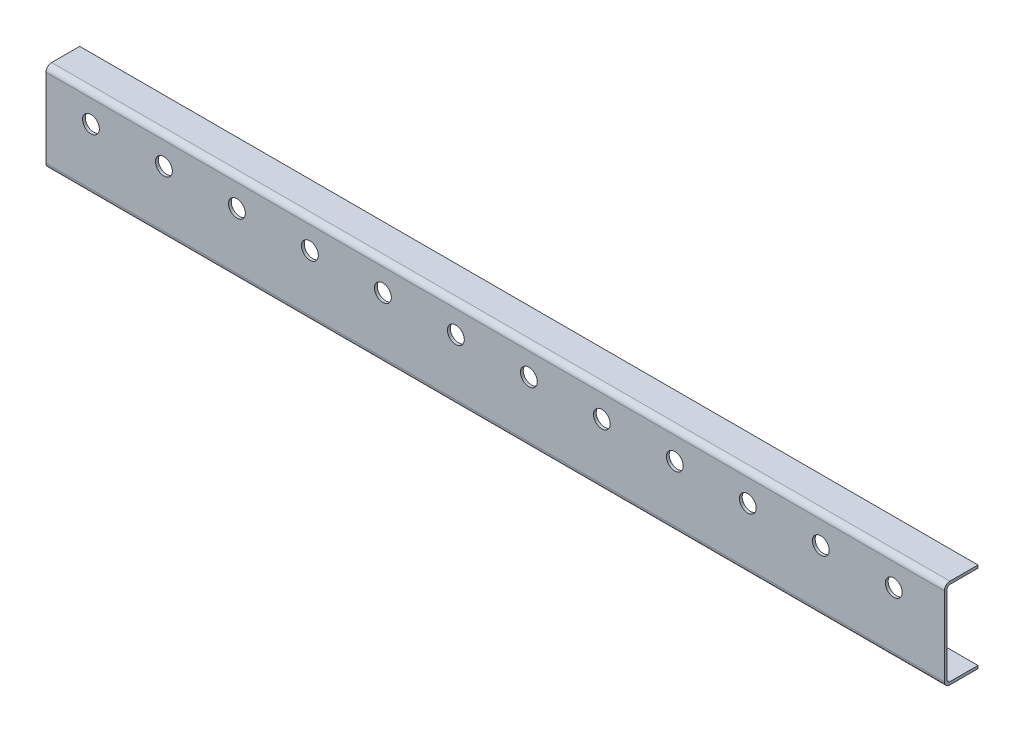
ISO-10303-21;
HEADER;
FILE_DESCRIPTION(('STEP AP214'),'2;1');
FILE_NAME('part.step','',(''),(''),'','','');
FILE_SCHEMA(('AUTOMOTIVE_DESIGN { 1 0 10303 214 1 1 1 1 }'));
ENDSEC;
DATA;
#1=APPLICATION_CONTEXT('core data for automotive mechanical design processes');
#2=APPLICATION_PROTOCOL_DEFINITION('international standard','automotive_design',2000,#1);
#3=PRODUCT_CONTEXT('',#1,'mechanical');
#4=PRODUCT('Part','Part','',(#3));
#5=PRODUCT_RELATED_PRODUCT_CATEGORY('part','',(#4));
#6=PRODUCT_DEFINITION_FORMATION('','',#4);
#7=PRODUCT_DEFINITION_CONTEXT('part definition',#1,'design');
#8=PRODUCT_DEFINITION('design','',#6,#7);
#9=PRODUCT_DEFINITION_SHAPE('','',#8);
#10=(LENGTH_UNIT() NAMED_UNIT(*) SI_UNIT(.MILLI.,.METRE.));
#11=(NAMED_UNIT(*) PLANE_ANGLE_UNIT() SI_UNIT($,.RADIAN.));
#12=(NAMED_UNIT(*) SI_UNIT($,.STERADIAN.) SOLID_ANGLE_UNIT());
#13=UNCERTAINTY_MEASURE_WITH_UNIT(LENGTH_MEASURE(1.E-05),#10,'distance_accuracy_value','');
#14=(GEOMETRIC_REPRESENTATION_CONTEXT(3) GLOBAL_UNCERTAINTY_ASSIGNED_CONTEXT((#13)) GLOBAL_UNIT_ASSIGNED_CONTEXT((#10,
#11,#12)) REPRESENTATION_CONTEXT('',''));
#15=CARTESIAN_POINT('',(0.,0.,0.));
#16=DIRECTION('',(0.,0.,1.));
#17=DIRECTION('',(1.,0.,0.));
#18=AXIS2_PLACEMENT_3D('',#15,#16,#17);
#19=CARTESIAN_POINT('',(1016.,-3.175,-38.1));
#20=DIRECTION('',(0.,0.,-1.));
#21=DIRECTION('',(1.,0.,0.));
#22=AXIS2_PLACEMENT_3D('',#19,#20,#21);
#23=PLANE('',#22);
#24=DIRECTION('',(0.,1.,0.));
#25=VECTOR('',#24,1.);
#26=CARTESIAN_POINT('',(0.,-3.175,-38.1));
#27=LINE('',#26,#25);
#28=CARTESIAN_POINT('',(0.,-3.175,-38.1));
#29=VERTEX_POINT('',#28);
#30=CARTESIAN_POINT('',(0.,0.,-38.1));
#31=VERTEX_POINT('',#30);
#32=EDGE_CURVE('E145',#29,#31,#27,.T.);
#33=ORIENTED_EDGE('',*,*,#32,.T.);
#34=DIRECTION('',(-1.,0.,0.));
#35=VECTOR('',#34,1.);
#36=CARTESIAN_POINT('',(1016.,0.,-38.1));
#37=LINE('',#36,#35);
#38=CARTESIAN_POINT('',(1016.,0.,-38.1));
#39=VERTEX_POINT('',#38);
#40=EDGE_CURVE('E128',#39,#31,#37,.T.);
#41=ORIENTED_EDGE('',*,*,#40,.F.);
#42=DIRECTION('',(0.,1.,0.));
#43=VECTOR('',#42,1.);
#44=CARTESIAN_POINT('',(1016.,-3.175,-38.1));
#45=LINE('',#44,#43);
#46=CARTESIAN_POINT('',(1016.,-3.175,-38.1));
#47=VERTEX_POINT('',#46);
#48=EDGE_CURVE('E133',#47,#39,#45,.T.);
#49=ORIENTED_EDGE('',*,*,#48,.F.);
#50=DIRECTION('',(-1.,0.,0.));
#51=VECTOR('',#50,1.);
#52=CARTESIAN_POINT('',(1016.,-3.175,-38.1));
#53=LINE('',#52,#51);
#54=EDGE_CURVE('E159',#47,#29,#53,.T.);
#55=ORIENTED_EDGE('',*,*,#54,.T.);
#56=EDGE_LOOP('',(#33,#41,#49,#55));
#57=FACE_BOUND('',#56,.T.);
#58=ADVANCED_FACE('F35',(#57),#23,.T.);
#59=CARTESIAN_POINT('',(1016.,-3.175,0.));
#60=DIRECTION('',(0.,-1.,0.));
#61=DIRECTION('',(0.,0.,1.));
#62=AXIS2_PLACEMENT_3D('',#59,#60,#61);
#63=PLANE('',#62);
#64=DIRECTION('',(0.,0.,-1.));
#65=VECTOR('',#64,1.);
#66=CARTESIAN_POINT('',(0.,-3.175,0.));
#67=LINE('',#66,#65);
#68=CARTESIAN_POINT('',(0.,-3.175,-6.35));
#69=VERTEX_POINT('',#68);
#70=EDGE_CURVE('E142',#69,#29,#67,.T.);
#71=ORIENTED_EDGE('',*,*,#70,.T.);
#72=ORIENTED_EDGE('',*,*,#54,.F.);
#73=DIRECTION('',(0.,0.,-1.));
#74=VECTOR('',#73,1.);
#75=CARTESIAN_POINT('',(1016.,-3.175,0.));
#76=LINE('',#75,#74);
#77=CARTESIAN_POINT('',(1016.,-3.175,-6.35));
#78=VERTEX_POINT('',#77);
#79=EDGE_CURVE('E138',#78,#47,#76,.T.);
#80=ORIENTED_EDGE('',*,*,#79,.F.);
#81=DIRECTION('',(-1.,0.,0.));
#82=VECTOR('',#81,1.);
#83=CARTESIAN_POINT('',(1016.,-3.175,-6.35));
#84=LINE('',#83,#82);
#85=EDGE_CURVE('E162',#69,#78,#84,.F.);
#86=ORIENTED_EDGE('',*,*,#85,.F.);
#87=EDGE_LOOP('',(#71,#72,#80,#86));
#88=FACE_BOUND('',#87,.T.);
#89=ADVANCED_FACE('F257',(#88),#63,.T.);
#90=CARTESIAN_POINT('',(1016.,0.,-3.175));
#91=DIRECTION('',(0.,0.,1.));
#92=DIRECTION('',(0.,1.,0.));
#93=AXIS2_PLACEMENT_3D('',#90,#91,#92);
#94=PLANE('',#93);
#95=CARTESIAN_POINT('',(133.35,-31.75,-3.175));
#96=DIRECTION('',(0.,0.,-1.));
#97=DIRECTION('',(0.,1.,0.));
#98=AXIS2_PLACEMENT_3D('',#95,#96,#97);
#99=CIRCLE('',#98,9.525);
#100=CARTESIAN_POINT('',(133.35,-22.225,-3.175));
#101=VERTEX_POINT('',#100);
#102=EDGE_CURVE('E397',#101,#101,#99,.T.);
#103=ORIENTED_EDGE('',*,*,#102,.F.);
#104=EDGE_LOOP('',(#103));
#105=FACE_BOUND('',#104,.T.);
#106=CARTESIAN_POINT('',(50.8,-31.75,-3.175));
#107=DIRECTION('',(0.,0.,-1.));
#108=DIRECTION('',(0.,1.,0.));
#109=AXIS2_PLACEMENT_3D('',#106,#107,#108);
#110=CIRCLE('',#109,9.525);
#111=CARTESIAN_POINT('',(50.8,-22.225,-3.175));
#112=VERTEX_POINT('',#111);
#113=EDGE_CURVE('E382',#112,#112,#110,.T.);
#114=ORIENTED_EDGE('',*,*,#113,.F.);
#115=EDGE_LOOP('',(#114));
#116=FACE_BOUND('',#115,.T.);
#117=DIRECTION('',(0.,-1.,0.));
#118=VECTOR('',#117,1.);
#119=CARTESIAN_POINT('',(1016.,0.,-3.175));
#120=LINE('',#119,#118);
#121=CARTESIAN_POINT('',(1016.,-6.35,-3.175));
#122=VERTEX_POINT('',#121);
#123=CARTESIAN_POINT('',(1016.,-95.25,-3.17499999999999));
#124=VERTEX_POINT('',#123);
#125=EDGE_CURVE('E151',#122,#124,#120,.T.);
#126=ORIENTED_EDGE('',*,*,#125,.T.);
#127=DIRECTION('',(-1.,0.,0.));
#128=VECTOR('',#127,1.);
#129=CARTESIAN_POINT('',(1016.,-95.25,-3.17499999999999));
#130=LINE('',#129,#128);
#131=CARTESIAN_POINT('',(0.,-95.25,-3.17499999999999));
#132=VERTEX_POINT('',#131);
#133=EDGE_CURVE('E155',#132,#124,#130,.F.);
#134=ORIENTED_EDGE('',*,*,#133,.F.);
#135=DIRECTION('',(0.,-1.,0.));
#136=VECTOR('',#135,1.);
#137=CARTESIAN_POINT('',(0.,0.,-3.175));
#138=LINE('',#137,#136);
#139=CARTESIAN_POINT('',(0.,-6.35,-3.175));
#140=VERTEX_POINT('',#139);
#141=EDGE_CURVE('E368',#140,#132,#138,.T.);
#142=ORIENTED_EDGE('',*,*,#141,.F.);
#143=DIRECTION('',(-1.,0.,0.));
#144=VECTOR('',#143,1.);
#145=CARTESIAN_POINT('',(1016.,-6.35,-3.175));
#146=LINE('',#145,#144);
#147=EDGE_CURVE('E158',#122,#140,#146,.T.);
#148=ORIENTED_EDGE('',*,*,#147,.F.);
#149=EDGE_LOOP('',(#126,#134,#142,#148));
#150=FACE_BOUND('',#149,.T.);
#151=CARTESIAN_POINT('',(215.9,-31.75,-3.175));
#152=DIRECTION('',(0.,0.,-1.));
#153=DIRECTION('',(0.,1.,0.));
#154=AXIS2_PLACEMENT_3D('',#151,#152,#153);
#155=CIRCLE('',#154,9.525);
#156=CARTESIAN_POINT('',(215.9,-22.225,-3.175));
#157=VERTEX_POINT('',#156);
#158=EDGE_CURVE('E194',#157,#157,#155,.T.);
#159=ORIENTED_EDGE('',*,*,#158,.F.);
#160=EDGE_LOOP('',(#159));
#161=FACE_BOUND('',#160,.T.);
#162=CARTESIAN_POINT('',(298.45,-31.75,-3.175));
#163=DIRECTION('',(0.,0.,-1.));
#164=DIRECTION('',(0.,1.,0.));
#165=AXIS2_PLACEMENT_3D('',#162,#163,#164);
#166=CIRCLE('',#165,9.525);
#167=CARTESIAN_POINT('',(298.45,-22.225,-3.175));
#168=VERTEX_POINT('',#167);
#169=EDGE_CURVE('E200',#168,#168,#166,.T.);
#170=ORIENTED_EDGE('',*,*,#169,.F.);
#171=EDGE_LOOP('',(#170));
#172=FACE_BOUND('',#171,.T.);
#173=CARTESIAN_POINT('',(381.,-31.75,-3.175));
#174=DIRECTION('',(0.,0.,-1.));
#175=DIRECTION('',(0.,1.,0.));
#176=AXIS2_PLACEMENT_3D('',#173,#174,#175);
#177=CIRCLE('',#176,9.525);
#178=CARTESIAN_POINT('',(381.,-22.225,-3.175));
#179=VERTEX_POINT('',#178);
#180=EDGE_CURVE('E206',#179,#179,#177,.T.);
#181=ORIENTED_EDGE('',*,*,#180,.F.);
#182=EDGE_LOOP('',(#181));
#183=FACE_BOUND('',#182,.T.);
#184=CARTESIAN_POINT('',(463.55,-31.75,-3.175));
#185=DIRECTION('',(0.,0.,-1.));
#186=DIRECTION('',(0.,1.,0.));
#187=AXIS2_PLACEMENT_3D('',#184,#185,#186);
#188=CIRCLE('',#187,9.525);
#189=CARTESIAN_POINT('',(463.55,-22.225,-3.175));
#190=VERTEX_POINT('',#189);
#191=EDGE_CURVE('E212',#190,#190,#188,.T.);
#192=ORIENTED_EDGE('',*,*,#191,.F.);
#193=EDGE_LOOP('',(#192));
#194=FACE_BOUND('',#193,.T.);
#195=CARTESIAN_POINT('',(546.1,-31.75,-3.175));
#196=DIRECTION('',(0.,0.,-1.));
#197=DIRECTION('',(0.,1.,0.));
#198=AXIS2_PLACEMENT_3D('',#195,#196,#197);
#199=CIRCLE('',#198,9.525);
#200=CARTESIAN_POINT('',(546.1,-22.225,-3.175));
#201=VERTEX_POINT('',#200);
#202=EDGE_CURVE('E218',#201,#201,#199,.T.);
#203=ORIENTED_EDGE('',*,*,#202,.F.);
#204=EDGE_LOOP('',(#203));
#205=FACE_BOUND('',#204,.T.);
#206=CARTESIAN_POINT('',(628.65,-31.75,-3.175));
#207=DIRECTION('',(0.,0.,-1.));
#208=DIRECTION('',(0.,1.,0.));
#209=AXIS2_PLACEMENT_3D('',#206,#207,#208);
#210=CIRCLE('',#209,9.525);
#211=CARTESIAN_POINT('',(628.65,-22.225,-3.175));
#212=VERTEX_POINT('',#211);
#213=EDGE_CURVE('E224',#212,#212,#210,.T.);
#214=ORIENTED_EDGE('',*,*,#213,.F.);
#215=EDGE_LOOP('',(#214));
#216=FACE_BOUND('',#215,.T.);
#217=CARTESIAN_POINT('',(711.2,-31.75,-3.175));
#218=DIRECTION('',(0.,0.,-1.));
#219=DIRECTION('',(0.,1.,0.));
#220=AXIS2_PLACEMENT_3D('',#217,#218,#219);
#221=CIRCLE('',#220,9.525);
#222=CARTESIAN_POINT('',(711.2,-22.225,-3.175));
#223=VERTEX_POINT('',#222);
#224=EDGE_CURVE('E230',#223,#223,#221,.T.);
#225=ORIENTED_EDGE('',*,*,#224,.F.);
#226=EDGE_LOOP('',(#225));
#227=FACE_BOUND('',#226,.T.);
#228=CARTESIAN_POINT('',(793.75,-31.75,-3.175));
#229=DIRECTION('',(0.,0.,-1.));
#230=DIRECTION('',(0.,1.,0.));
#231=AXIS2_PLACEMENT_3D('',#228,#229,#230);
#232=CIRCLE('',#231,9.525);
#233=CARTESIAN_POINT('',(793.75,-22.225,-3.175));
#234=VERTEX_POINT('',#233);
#235=EDGE_CURVE('E236',#234,#234,#232,.T.);
#236=ORIENTED_EDGE('',*,*,#235,.F.);
#237=EDGE_LOOP('',(#236));
#238=FACE_BOUND('',#237,.T.);
#239=CARTESIAN_POINT('',(876.3,-31.75,-3.175));
#240=DIRECTION('',(0.,0.,-1.));
#241=DIRECTION('',(0.,1.,0.));
#242=AXIS2_PLACEMENT_3D('',#239,#240,#241);
#243=CIRCLE('',#242,9.525);
#244=CARTESIAN_POINT('',(876.3,-22.225,-3.175));
#245=VERTEX_POINT('',#244);
#246=EDGE_CURVE('E242',#245,#245,#243,.T.);
#247=ORIENTED_EDGE('',*,*,#246,.F.);
#248=EDGE_LOOP('',(#247));
#249=FACE_BOUND('',#248,.T.);
#250=CARTESIAN_POINT('',(958.85,-31.75,-3.175));
#251=DIRECTION('',(0.,0.,-1.));
#252=DIRECTION('',(0.,1.,0.));
#253=AXIS2_PLACEMENT_3D('',#250,#251,#252);
#254=CIRCLE('',#253,9.525);
#255=CARTESIAN_POINT('',(958.85,-22.225,-3.175));
#256=VERTEX_POINT('',#255);
#257=EDGE_CURVE('E11',#256,#256,#254,.T.);
#258=ORIENTED_EDGE('',*,*,#257,.F.);
#259=EDGE_LOOP('',(#258));
#260=FACE_BOUND('',#259,.T.);
#261=ADVANCED_FACE('F254',(#105,#116,#150,#161,#172,#183,#194,#205,#216,#227,#238,#249,#260),
#94,.F.);
#262=CARTESIAN_POINT('',(1016.,-98.425,0.));
#263=DIRECTION('',(0.,-1.,0.));
#264=DIRECTION('',(0.,0.,1.));
#265=AXIS2_PLACEMENT_3D('',#262,#263,#264);
#266=PLANE('',#265);
#267=DIRECTION('',(0.,0.,1.));
#268=VECTOR('',#267,1.);
#269=CARTESIAN_POINT('',(1016.,-98.425,0.));
#270=LINE('',#269,#268);
#271=CARTESIAN_POINT('',(1016.,-98.425,-6.34999999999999));
#272=VERTEX_POINT('',#271);
#273=CARTESIAN_POINT('',(1016.,-98.425,-38.1));
#274=VERTEX_POINT('',#273);
#275=EDGE_CURVE('E371',#272,#274,#270,.F.);
#276=ORIENTED_EDGE('',*,*,#275,.T.);
#277=DIRECTION('',(-1.,0.,0.));
#278=VECTOR('',#277,1.);
#279=CARTESIAN_POINT('',(1016.,-98.425,-38.1));
#280=LINE('',#279,#278);
#281=CARTESIAN_POINT('',(0.,-98.425,-38.1));
#282=VERTEX_POINT('',#281);
#283=EDGE_CURVE('E149',#274,#282,#280,.T.);
#284=ORIENTED_EDGE('',*,*,#283,.T.);
#285=DIRECTION('',(0.,0.,1.));
#286=VECTOR('',#285,1.);
#287=CARTESIAN_POINT('',(0.,-98.425,0.));
#288=LINE('',#287,#286);
#289=CARTESIAN_POINT('',(0.,-98.425,-6.34999999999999));
#290=VERTEX_POINT('',#289);
#291=EDGE_CURVE('E362',#290,#282,#288,.F.);
#292=ORIENTED_EDGE('',*,*,#291,.F.);
#293=DIRECTION('',(-1.,0.,0.));
#294=VECTOR('',#293,1.);
#295=CARTESIAN_POINT('',(0.,-98.425,-6.34999999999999));
#296=LINE('',#295,#294);
#297=EDGE_CURVE('E165',#272,#290,#296,.T.);
#298=ORIENTED_EDGE('',*,*,#297,.F.);
#299=EDGE_LOOP('',(#276,#284,#292,#298));
#300=FACE_BOUND('',#299,.T.);
#301=ADVANCED_FACE('F256',(#300),#266,.F.);
#302=CARTESIAN_POINT('',(1016.,-98.425,-38.1));
#303=DIRECTION('',(0.,0.,1.));
#304=DIRECTION('',(-1.,0.,0.));
#305=AXIS2_PLACEMENT_3D('',#302,#303,#304);
#306=PLANE('',#305);
#307=DIRECTION('',(0.,-1.,0.));
#308=VECTOR('',#307,1.);
#309=CARTESIAN_POINT('',(0.,-98.425,-38.1));
#310=LINE('',#309,#308);
#311=CARTESIAN_POINT('',(0.,-101.6,-38.1));
#312=VERTEX_POINT('',#311);
#313=EDGE_CURVE('E354',#282,#312,#310,.T.);
#314=ORIENTED_EDGE('',*,*,#313,.F.);
#315=ORIENTED_EDGE('',*,*,#283,.F.);
#316=DIRECTION('',(0.,-1.,0.));
#317=VECTOR('',#316,1.);
#318=CARTESIAN_POINT('',(1016.,-98.425,-38.1));
#319=LINE('',#318,#317);
#320=CARTESIAN_POINT('',(1016.,-101.6,-38.1));
#321=VERTEX_POINT('',#320);
#322=EDGE_CURVE('E387',#274,#321,#319,.T.);
#323=ORIENTED_EDGE('',*,*,#322,.T.);
#324=DIRECTION('',(-1.,0.,0.));
#325=VECTOR('',#324,1.);
#326=CARTESIAN_POINT('',(1016.,-101.6,-38.1));
#327=LINE('',#326,#325);
#328=EDGE_CURVE('E146',#321,#312,#327,.T.);
#329=ORIENTED_EDGE('',*,*,#328,.T.);
#330=EDGE_LOOP('',(#314,#315,#323,#329));
#331=FACE_BOUND('',#330,.T.);
#332=ADVANCED_FACE('F264',(#331),#306,.F.);
#333=CARTESIAN_POINT('',(1016.,-101.6,0.));
#334=DIRECTION('',(0.,-1.,0.));
#335=DIRECTION('',(0.,0.,1.));
#336=AXIS2_PLACEMENT_3D('',#333,#334,#335);
#337=PLANE('',#336);
#338=DIRECTION('',(0.,0.,-1.));
#339=VECTOR('',#338,1.);
#340=CARTESIAN_POINT('',(0.,-101.6,0.));
#341=LINE('',#340,#339);
#342=CARTESIAN_POINT('',(0.,-101.6,-6.34999999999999));
#343=VERTEX_POINT('',#342);
#344=EDGE_CURVE('E363',#343,#312,#341,.T.);
#345=ORIENTED_EDGE('',*,*,#344,.T.);
#346=ORIENTED_EDGE('',*,*,#328,.F.);
#347=DIRECTION('',(0.,0.,-1.));
#348=VECTOR('',#347,1.);
#349=CARTESIAN_POINT('',(1016.,-101.6,0.));
#350=LINE('',#349,#348);
#351=CARTESIAN_POINT('',(1016.,-101.6,-6.34999999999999));
#352=VERTEX_POINT('',#351);
#353=EDGE_CURVE('E389',#352,#321,#350,.T.);
#354=ORIENTED_EDGE('',*,*,#353,.F.);
#355=DIRECTION('',(-1.,0.,0.));
#356=VECTOR('',#355,1.);
#357=CARTESIAN_POINT('',(1016.,-101.6,-6.34999999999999));
#358=LINE('',#357,#356);
#359=EDGE_CURVE('E189',#343,#352,#358,.F.);
#360=ORIENTED_EDGE('',*,*,#359,.F.);
#361=EDGE_LOOP('',(#345,#346,#354,#360));
#362=FACE_BOUND('',#361,.T.);
#363=ADVANCED_FACE('F337',(#362),#337,.T.);
#364=CARTESIAN_POINT('',(1016.,0.,0.));
#365=DIRECTION('',(0.,0.,1.));
#366=DIRECTION('',(0.,1.,0.));
#367=AXIS2_PLACEMENT_3D('',#364,#365,#366);
#368=PLANE('',#367);
#369=CARTESIAN_POINT('',(133.35,-31.75,0.));
#370=DIRECTION('',(0.,0.,-1.));
#371=DIRECTION('',(0.,1.,0.));
#372=AXIS2_PLACEMENT_3D('',#369,#370,#371);
#373=CIRCLE('',#372,9.525);
#374=CARTESIAN_POINT('',(133.35,-22.225,0.));
#375=VERTEX_POINT('',#374);
#376=EDGE_CURVE('E400',#375,#375,#373,.T.);
#377=ORIENTED_EDGE('',*,*,#376,.T.);
#378=EDGE_LOOP('',(#377));
#379=FACE_BOUND('',#378,.T.);
#380=CARTESIAN_POINT('',(50.8,-31.75,0.));
#381=DIRECTION('',(0.,0.,-1.));
#382=DIRECTION('',(0.,1.,0.));
#383=AXIS2_PLACEMENT_3D('',#380,#381,#382);
#384=CIRCLE('',#383,9.525);
#385=CARTESIAN_POINT('',(50.8,-22.225,0.));
#386=VERTEX_POINT('',#385);
#387=EDGE_CURVE('E394',#386,#386,#384,.T.);
#388=ORIENTED_EDGE('',*,*,#387,.T.);
#389=EDGE_LOOP('',(#388));
#390=FACE_BOUND('',#389,.T.);
#391=DIRECTION('',(0.,-1.,0.));
#392=VECTOR('',#391,1.);
#393=CARTESIAN_POINT('',(0.,0.,0.));
#394=LINE('',#393,#392);
#395=CARTESIAN_POINT('',(0.,-6.35,0.));
#396=VERTEX_POINT('',#395);
#397=CARTESIAN_POINT('',(0.,-95.25,0.));
#398=VERTEX_POINT('',#397);
#399=EDGE_CURVE('E377',#396,#398,#394,.T.);
#400=ORIENTED_EDGE('',*,*,#399,.T.);
#401=DIRECTION('',(-1.,0.,0.));
#402=VECTOR('',#401,1.);
#403=CARTESIAN_POINT('',(1016.,-95.25,0.));
#404=LINE('',#403,#402);
#405=CARTESIAN_POINT('',(1016.,-95.25,0.));
#406=VERTEX_POINT('',#405);
#407=EDGE_CURVE('E181',#406,#398,#404,.T.);
#408=ORIENTED_EDGE('',*,*,#407,.F.);
#409=DIRECTION('',(0.,-1.,0.));
#410=VECTOR('',#409,1.);
#411=CARTESIAN_POINT('',(1016.,0.,0.));
#412=LINE('',#411,#410);
#413=CARTESIAN_POINT('',(1016.,-6.35,0.));
#414=VERTEX_POINT('',#413);
#415=EDGE_CURVE('E132',#414,#406,#412,.T.);
#416=ORIENTED_EDGE('',*,*,#415,.F.);
#417=DIRECTION('',(-1.,0.,0.));
#418=VECTOR('',#417,1.);
#419=CARTESIAN_POINT('',(1016.,-6.35,0.));
#420=LINE('',#419,#418);
#421=EDGE_CURVE('E183',#396,#414,#420,.F.);
#422=ORIENTED_EDGE('',*,*,#421,.F.);
#423=EDGE_LOOP('',(#400,#408,#416,#422));
#424=FACE_BOUND('',#423,.T.);
#425=CARTESIAN_POINT('',(215.9,-31.75,0.));
#426=DIRECTION('',(0.,0.,-1.));
#427=DIRECTION('',(0.,1.,0.));
#428=AXIS2_PLACEMENT_3D('',#425,#426,#427);
#429=CIRCLE('',#428,9.525);
#430=CARTESIAN_POINT('',(215.9,-22.225,0.));
#431=VERTEX_POINT('',#430);
#432=EDGE_CURVE('E191',#431,#431,#429,.T.);
#433=ORIENTED_EDGE('',*,*,#432,.T.);
#434=EDGE_LOOP('',(#433));
#435=FACE_BOUND('',#434,.T.);
#436=CARTESIAN_POINT('',(298.45,-31.75,0.));
#437=DIRECTION('',(0.,0.,-1.));
#438=DIRECTION('',(0.,1.,0.));
#439=AXIS2_PLACEMENT_3D('',#436,#437,#438);
#440=CIRCLE('',#439,9.525);
#441=CARTESIAN_POINT('',(298.45,-22.225,0.));
#442=VERTEX_POINT('',#441);
#443=EDGE_CURVE('E197',#442,#442,#440,.T.);
#444=ORIENTED_EDGE('',*,*,#443,.T.);
#445=EDGE_LOOP('',(#444));
#446=FACE_BOUND('',#445,.T.);
#447=CARTESIAN_POINT('',(381.,-31.75,0.));
#448=DIRECTION('',(0.,0.,-1.));
#449=DIRECTION('',(0.,1.,0.));
#450=AXIS2_PLACEMENT_3D('',#447,#448,#449);
#451=CIRCLE('',#450,9.525);
#452=CARTESIAN_POINT('',(381.,-22.225,0.));
#453=VERTEX_POINT('',#452);
#454=EDGE_CURVE('E203',#453,#453,#451,.T.);
#455=ORIENTED_EDGE('',*,*,#454,.T.);
#456=EDGE_LOOP('',(#455));
#457=FACE_BOUND('',#456,.T.);
#458=CARTESIAN_POINT('',(463.55,-31.75,0.));
#459=DIRECTION('',(0.,0.,-1.));
#460=DIRECTION('',(0.,1.,0.));
#461=AXIS2_PLACEMENT_3D('',#458,#459,#460);
#462=CIRCLE('',#461,9.525);
#463=CARTESIAN_POINT('',(463.55,-22.225,0.));
#464=VERTEX_POINT('',#463);
#465=EDGE_CURVE('E209',#464,#464,#462,.T.);
#466=ORIENTED_EDGE('',*,*,#465,.T.);
#467=EDGE_LOOP('',(#466));
#468=FACE_BOUND('',#467,.T.);
#469=CARTESIAN_POINT('',(546.1,-31.75,0.));
#470=DIRECTION('',(0.,0.,-1.));
#471=DIRECTION('',(0.,1.,0.));
#472=AXIS2_PLACEMENT_3D('',#469,#470,#471);
#473=CIRCLE('',#472,9.525);
#474=CARTESIAN_POINT('',(546.1,-22.225,0.));
#475=VERTEX_POINT('',#474);
#476=EDGE_CURVE('E215',#475,#475,#473,.T.);
#477=ORIENTED_EDGE('',*,*,#476,.T.);
#478=EDGE_LOOP('',(#477));
#479=FACE_BOUND('',#478,.T.);
#480=CARTESIAN_POINT('',(628.65,-31.75,0.));
#481=DIRECTION('',(0.,0.,-1.));
#482=DIRECTION('',(0.,1.,0.));
#483=AXIS2_PLACEMENT_3D('',#480,#481,#482);
#484=CIRCLE('',#483,9.525);
#485=CARTESIAN_POINT('',(628.65,-22.225,0.));
#486=VERTEX_POINT('',#485);
#487=EDGE_CURVE('E221',#486,#486,#484,.T.);
#488=ORIENTED_EDGE('',*,*,#487,.T.);
#489=EDGE_LOOP('',(#488));
#490=FACE_BOUND('',#489,.T.);
#491=CARTESIAN_POINT('',(711.2,-31.75,0.));
#492=DIRECTION('',(0.,0.,-1.));
#493=DIRECTION('',(0.,1.,0.));
#494=AXIS2_PLACEMENT_3D('',#491,#492,#493);
#495=CIRCLE('',#494,9.525);
#496=CARTESIAN_POINT('',(711.2,-22.225,0.));
#497=VERTEX_POINT('',#496);
#498=EDGE_CURVE('E227',#497,#497,#495,.T.);
#499=ORIENTED_EDGE('',*,*,#498,.T.);
#500=EDGE_LOOP('',(#499));
#501=FACE_BOUND('',#500,.T.);
#502=CARTESIAN_POINT('',(793.75,-31.75,0.));
#503=DIRECTION('',(0.,0.,-1.));
#504=DIRECTION('',(0.,1.,0.));
#505=AXIS2_PLACEMENT_3D('',#502,#503,#504);
#506=CIRCLE('',#505,9.525);
#507=CARTESIAN_POINT('',(793.75,-22.225,0.));
#508=VERTEX_POINT('',#507);
#509=EDGE_CURVE('E233',#508,#508,#506,.T.);
#510=ORIENTED_EDGE('',*,*,#509,.T.);
#511=EDGE_LOOP('',(#510));
#512=FACE_BOUND('',#511,.T.);
#513=CARTESIAN_POINT('',(876.3,-31.75,0.));
#514=DIRECTION('',(0.,0.,-1.));
#515=DIRECTION('',(0.,1.,0.));
#516=AXIS2_PLACEMENT_3D('',#513,#514,#515);
#517=CIRCLE('',#516,9.525);
#518=CARTESIAN_POINT('',(876.3,-22.225,0.));
#519=VERTEX_POINT('',#518);
#520=EDGE_CURVE('E239',#519,#519,#517,.T.);
#521=ORIENTED_EDGE('',*,*,#520,.T.);
#522=EDGE_LOOP('',(#521));
#523=FACE_BOUND('',#522,.T.);
#524=CARTESIAN_POINT('',(958.85,-31.75,0.));
#525=DIRECTION('',(0.,0.,-1.));
#526=DIRECTION('',(0.,1.,0.));
#527=AXIS2_PLACEMENT_3D('',#524,#525,#526);
#528=CIRCLE('',#527,9.525);
#529=CARTESIAN_POINT('',(958.85,-22.225,0.));
#530=VERTEX_POINT('',#529);
#531=EDGE_CURVE('E43',#530,#530,#528,.T.);
#532=ORIENTED_EDGE('',*,*,#531,.T.);
#533=EDGE_LOOP('',(#532));
#534=FACE_BOUND('',#533,.T.);
#535=ADVANCED_FACE('F247',(#379,#390,#424,#435,#446,#457,#468,#479,#490,#501,#512,#523,#534),
#368,.T.);
#536=CARTESIAN_POINT('',(1016.,0.,0.));
#537=DIRECTION('',(0.,-1.,0.));
#538=DIRECTION('',(0.,0.,1.));
#539=AXIS2_PLACEMENT_3D('',#536,#537,#538);
#540=PLANE('',#539);
#541=DIRECTION('',(0.,0.,-1.));
#542=VECTOR('',#541,1.);
#543=CARTESIAN_POINT('',(1016.,0.,0.));
#544=LINE('',#543,#542);
#545=CARTESIAN_POINT('',(1016.,0.,-6.35));
#546=VERTEX_POINT('',#545);
#547=EDGE_CURVE('E123',#546,#39,#544,.T.);
#548=ORIENTED_EDGE('',*,*,#547,.T.);
#549=ORIENTED_EDGE('',*,*,#40,.T.);
#550=DIRECTION('',(0.,0.,-1.));
#551=VECTOR('',#550,1.);
#552=CARTESIAN_POINT('',(0.,0.,0.));
#553=LINE('',#552,#551);
#554=CARTESIAN_POINT('',(0.,0.,-6.35));
#555=VERTEX_POINT('',#554);
#556=EDGE_CURVE('E380',#555,#31,#553,.T.);
#557=ORIENTED_EDGE('',*,*,#556,.F.);
#558=DIRECTION('',(-1.,0.,0.));
#559=VECTOR('',#558,1.);
#560=CARTESIAN_POINT('',(0.,0.,-6.35));
#561=LINE('',#560,#559);
#562=EDGE_CURVE('E131',#546,#555,#561,.T.);
#563=ORIENTED_EDGE('',*,*,#562,.F.);
#564=EDGE_LOOP('',(#548,#549,#557,#563));
#565=FACE_BOUND('',#564,.T.);
#566=ADVANCED_FACE('F125',(#565),#540,.F.);
#567=CARTESIAN_POINT('',(1016.,-101.6,-38.1));
#568=DIRECTION('',(1.,0.,0.));
#569=DIRECTION('',(0.,0.,1.));
#570=AXIS2_PLACEMENT_3D('',#567,#568,#569);
#571=PLANE('',#570);
#572=ORIENTED_EDGE('',*,*,#415,.T.);
#573=CARTESIAN_POINT('',(1016.,-95.25,-6.34999999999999));
#574=DIRECTION('',(-1.,0.,0.));
#575=DIRECTION('',(0.,0.,1.));
#576=AXIS2_PLACEMENT_3D('',#573,#574,#575);
#577=CIRCLE('',#576,6.35);
#578=EDGE_CURVE('E50',#352,#406,#577,.T.);
#579=ORIENTED_EDGE('',*,*,#578,.F.);
#580=ORIENTED_EDGE('',*,*,#353,.T.);
#581=ORIENTED_EDGE('',*,*,#322,.F.);
#582=ORIENTED_EDGE('',*,*,#275,.F.);
#583=CARTESIAN_POINT('',(1016.,-95.25,-6.34999999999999));
#584=DIRECTION('',(-1.,0.,0.));
#585=DIRECTION('',(0.,0.,1.));
#586=AXIS2_PLACEMENT_3D('',#583,#584,#585);
#587=CIRCLE('',#586,3.175);
#588=EDGE_CURVE('E174',#124,#272,#587,.F.);
#589=ORIENTED_EDGE('',*,*,#588,.F.);
#590=ORIENTED_EDGE('',*,*,#125,.F.);
#591=CARTESIAN_POINT('',(1016.,-6.35,-6.35));
#592=DIRECTION('',(-1.,0.,0.));
#593=DIRECTION('',(0.,0.,1.));
#594=AXIS2_PLACEMENT_3D('',#591,#592,#593);
#595=CIRCLE('',#594,3.175);
#596=EDGE_CURVE('E170',#78,#122,#595,.F.);
#597=ORIENTED_EDGE('',*,*,#596,.F.);
#598=ORIENTED_EDGE('',*,*,#79,.T.);
#599=ORIENTED_EDGE('',*,*,#48,.T.);
#600=ORIENTED_EDGE('',*,*,#547,.F.);
#601=CARTESIAN_POINT('',(1016.,-6.35,-6.35));
#602=DIRECTION('',(-1.,0.,0.));
#603=DIRECTION('',(0.,0.,1.));
#604=AXIS2_PLACEMENT_3D('',#601,#602,#603);
#605=CIRCLE('',#604,6.35);
#606=EDGE_CURVE('E187',#414,#546,#605,.T.);
#607=ORIENTED_EDGE('',*,*,#606,.F.);
#608=EDGE_LOOP('',(#572,#579,#580,#581,#582,#589,#590,#597,#598,#599,#600,#607));
#609=FACE_BOUND('',#608,.T.);
#610=ADVANCED_FACE('F136',(#609),#571,.T.);
#611=CARTESIAN_POINT('',(0.,-101.6,-38.1));
#612=DIRECTION('',(1.,0.,0.));
#613=DIRECTION('',(0.,0.,1.));
#614=AXIS2_PLACEMENT_3D('',#611,#612,#613);
#615=PLANE('',#614);
#616=ORIENTED_EDGE('',*,*,#556,.T.);
#617=ORIENTED_EDGE('',*,*,#32,.F.);
#618=ORIENTED_EDGE('',*,*,#70,.F.);
#619=CARTESIAN_POINT('',(0.,-6.35,-6.35));
#620=DIRECTION('',(-1.,0.,0.));
#621=DIRECTION('',(0.,0.,1.));
#622=AXIS2_PLACEMENT_3D('',#619,#620,#621);
#623=CIRCLE('',#622,3.175);
#624=EDGE_CURVE('E168',#140,#69,#623,.T.);
#625=ORIENTED_EDGE('',*,*,#624,.F.);
#626=ORIENTED_EDGE('',*,*,#141,.T.);
#627=CARTESIAN_POINT('',(0.,-95.25,-6.34999999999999));
#628=DIRECTION('',(-1.,0.,0.));
#629=DIRECTION('',(0.,0.,1.));
#630=AXIS2_PLACEMENT_3D('',#627,#628,#629);
#631=CIRCLE('',#630,3.175);
#632=EDGE_CURVE('E172',#290,#132,#631,.T.);
#633=ORIENTED_EDGE('',*,*,#632,.F.);
#634=ORIENTED_EDGE('',*,*,#291,.T.);
#635=ORIENTED_EDGE('',*,*,#313,.T.);
#636=ORIENTED_EDGE('',*,*,#344,.F.);
#637=CARTESIAN_POINT('',(0.,-95.25,-6.34999999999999));
#638=DIRECTION('',(-1.,0.,0.));
#639=DIRECTION('',(0.,0.,1.));
#640=AXIS2_PLACEMENT_3D('',#637,#638,#639);
#641=CIRCLE('',#640,6.35);
#642=EDGE_CURVE('E177',#398,#343,#641,.F.);
#643=ORIENTED_EDGE('',*,*,#642,.F.);
#644=ORIENTED_EDGE('',*,*,#399,.F.);
#645=CARTESIAN_POINT('',(0.,-6.35,-6.35));
#646=DIRECTION('',(-1.,0.,0.));
#647=DIRECTION('',(0.,0.,1.));
#648=AXIS2_PLACEMENT_3D('',#645,#646,#647);
#649=CIRCLE('',#648,6.35);
#650=EDGE_CURVE('E179',#555,#396,#649,.F.);
#651=ORIENTED_EDGE('',*,*,#650,.F.);
#652=EDGE_LOOP('',(#616,#617,#618,#625,#626,#633,#634,#635,#636,#643,#644,#651));
#653=FACE_BOUND('',#652,.T.);
#654=ADVANCED_FACE('F282',(#653),#615,.F.);
#655=CARTESIAN_POINT('',(1016.,-6.35,-6.35));
#656=DIRECTION('',(-1.,0.,0.));
#657=DIRECTION('',(0.,0.,-1.));
#658=AXIS2_PLACEMENT_3D('',#655,#656,#657);
#659=CYLINDRICAL_SURFACE('',#658,3.175);
#660=ORIENTED_EDGE('',*,*,#596,.T.);
#661=ORIENTED_EDGE('',*,*,#147,.T.);
#662=ORIENTED_EDGE('',*,*,#624,.T.);
#663=ORIENTED_EDGE('',*,*,#85,.T.);
#664=EDGE_LOOP('',(#660,#661,#662,#663));
#665=FACE_BOUND('',#664,.T.);
#666=ADVANCED_FACE('F278',(#665),#659,.F.);
#667=CARTESIAN_POINT('',(1016.,-95.25,-6.34999999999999));
#668=DIRECTION('',(1.,0.,0.));
#669=DIRECTION('',(0.,0.,1.));
#670=AXIS2_PLACEMENT_3D('',#667,#668,#669);
#671=CYLINDRICAL_SURFACE('',#670,3.175);
#672=ORIENTED_EDGE('',*,*,#588,.T.);
#673=ORIENTED_EDGE('',*,*,#297,.T.);
#674=ORIENTED_EDGE('',*,*,#632,.T.);
#675=ORIENTED_EDGE('',*,*,#133,.T.);
#676=EDGE_LOOP('',(#672,#673,#674,#675));
#677=FACE_BOUND('',#676,.T.);
#678=ADVANCED_FACE('F281',(#677),#671,.F.);
#679=CARTESIAN_POINT('',(1016.,-6.35,-6.35));
#680=DIRECTION('',(1.,0.,0.));
#681=DIRECTION('',(0.,0.,1.));
#682=AXIS2_PLACEMENT_3D('',#679,#680,#681);
#683=CYLINDRICAL_SURFACE('',#682,6.35);
#684=ORIENTED_EDGE('',*,*,#606,.T.);
#685=ORIENTED_EDGE('',*,*,#562,.T.);
#686=ORIENTED_EDGE('',*,*,#650,.T.);
#687=ORIENTED_EDGE('',*,*,#421,.T.);
#688=EDGE_LOOP('',(#684,#685,#686,#687));
#689=FACE_BOUND('',#688,.T.);
#690=ADVANCED_FACE('F286',(#689),#683,.T.);
#691=CARTESIAN_POINT('',(1016.,-95.25,-6.34999999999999));
#692=DIRECTION('',(-1.,0.,0.));
#693=DIRECTION('',(0.,0.,-1.));
#694=AXIS2_PLACEMENT_3D('',#691,#692,#693);
#695=CYLINDRICAL_SURFACE('',#694,6.35);
#696=ORIENTED_EDGE('',*,*,#578,.T.);
#697=ORIENTED_EDGE('',*,*,#407,.T.);
#698=ORIENTED_EDGE('',*,*,#642,.T.);
#699=ORIENTED_EDGE('',*,*,#359,.T.);
#700=EDGE_LOOP('',(#696,#697,#698,#699));
#701=FACE_BOUND('',#700,.T.);
#702=ADVANCED_FACE('F290',(#701),#695,.T.);
#703=CARTESIAN_POINT('',(50.8,-31.75,-38.1));
#704=DIRECTION('',(0.,0.,1.));
#705=DIRECTION('',(0.,1.,0.));
#706=AXIS2_PLACEMENT_3D('',#703,#704,#705);
#707=CYLINDRICAL_SURFACE('',#706,9.525);
#708=CARTESIAN_POINT('',(50.8,-22.225,0.));
#709=CARTESIAN_POINT('',(50.8,-22.225,-0.0330729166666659));
#710=CARTESIAN_POINT('',(50.8,-22.225,-0.0661458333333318));
#711=CARTESIAN_POINT('',(50.8,-22.225,-0.132291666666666));
#712=CARTESIAN_POINT('',(50.8,-22.225,-0.165364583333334));
#713=CARTESIAN_POINT('',(50.8,-22.225,-0.231510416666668));
#714=CARTESIAN_POINT('',(50.8,-22.225,-0.264583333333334));
#715=CARTESIAN_POINT('',(50.8,-22.225,-0.330729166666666));
#716=CARTESIAN_POINT('',(50.8,-22.225,-0.363802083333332));
#717=CARTESIAN_POINT('',(50.8,-22.225,-0.429947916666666));
#718=CARTESIAN_POINT('',(50.8,-22.225,-0.463020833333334));
#719=CARTESIAN_POINT('',(50.8,-22.225,-0.529166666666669));
#720=CARTESIAN_POINT('',(50.8,-22.225,-0.562239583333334));
#721=CARTESIAN_POINT('',(50.8,-22.225,-0.628385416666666));
#722=CARTESIAN_POINT('',(50.8,-22.225,-0.661458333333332));
#723=CARTESIAN_POINT('',(50.8,-22.225,-0.727604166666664));
#724=CARTESIAN_POINT('',(50.8,-22.225,-0.76067708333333));
#725=CARTESIAN_POINT('',(50.8,-22.225,-0.826822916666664));
#726=CARTESIAN_POINT('',(50.8,-22.225,-0.859895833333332));
#727=CARTESIAN_POINT('',(50.8,-22.225,-0.926041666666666));
#728=CARTESIAN_POINT('',(50.8,-22.225,-0.959114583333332));
#729=CARTESIAN_POINT('',(50.8,-22.225,-1.02526041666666));
#730=CARTESIAN_POINT('',(50.8,-22.225,-1.05833333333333));
#731=CARTESIAN_POINT('',(50.8,-22.225,-1.12447916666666));
#732=CARTESIAN_POINT('',(50.8,-22.225,-1.15755208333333));
#733=CARTESIAN_POINT('',(50.8,-22.225,-1.22369791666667));
#734=CARTESIAN_POINT('',(50.8,-22.225,-1.25677083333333));
#735=CARTESIAN_POINT('',(50.8,-22.225,-1.32291666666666));
#736=CARTESIAN_POINT('',(50.8,-22.225,-1.35598958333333));
#737=CARTESIAN_POINT('',(50.8,-22.225,-1.42213541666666));
#738=CARTESIAN_POINT('',(50.8,-22.225,-1.45520833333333));
#739=CARTESIAN_POINT('',(50.8,-22.225,-1.52135416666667));
#740=CARTESIAN_POINT('',(50.8,-22.225,-1.55442708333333));
#741=CARTESIAN_POINT('',(50.8,-22.225,-1.62057291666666));
#742=CARTESIAN_POINT('',(50.8,-22.225,-1.65364583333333));
#743=CARTESIAN_POINT('',(50.8,-22.225,-1.71979166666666));
#744=CARTESIAN_POINT('',(50.8,-22.225,-1.75286458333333));
#745=CARTESIAN_POINT('',(50.8,-22.225,-1.81901041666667));
#746=CARTESIAN_POINT('',(50.8,-22.225,-1.85208333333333));
#747=CARTESIAN_POINT('',(50.8,-22.225,-1.91822916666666));
#748=CARTESIAN_POINT('',(50.8,-22.225,-1.95130208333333));
#749=CARTESIAN_POINT('',(50.8,-22.225,-2.01744791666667));
#750=CARTESIAN_POINT('',(50.8,-22.225,-2.05052083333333));
#751=CARTESIAN_POINT('',(50.8,-22.225,-2.11666666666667));
#752=CARTESIAN_POINT('',(50.8,-22.225,-2.14973958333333));
#753=CARTESIAN_POINT('',(50.8,-22.225,-2.21588541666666));
#754=CARTESIAN_POINT('',(50.8,-22.225,-2.24895833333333));
#755=CARTESIAN_POINT('',(50.8,-22.225,-2.31510416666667));
#756=CARTESIAN_POINT('',(50.8,-22.225,-2.34817708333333));
#757=CARTESIAN_POINT('',(50.8,-22.225,-2.41432291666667));
#758=CARTESIAN_POINT('',(50.8,-22.225,-2.44739583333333));
#759=CARTESIAN_POINT('',(50.8,-22.225,-2.51354166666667));
#760=CARTESIAN_POINT('',(50.8,-22.225,-2.54661458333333));
#761=CARTESIAN_POINT('',(50.8,-22.225,-2.61276041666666));
#762=CARTESIAN_POINT('',(50.8,-22.225,-2.64583333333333));
#763=CARTESIAN_POINT('',(50.8,-22.225,-2.71197916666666));
#764=CARTESIAN_POINT('',(50.8,-22.225,-2.74505208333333));
#765=CARTESIAN_POINT('',(50.8,-22.225,-2.81119791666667));
#766=CARTESIAN_POINT('',(50.8,-22.225,-2.84427083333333));
#767=CARTESIAN_POINT('',(50.8,-22.225,-2.91041666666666));
#768=CARTESIAN_POINT('',(50.8,-22.225,-2.94348958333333));
#769=CARTESIAN_POINT('',(50.8,-22.225,-3.00963541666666));
#770=CARTESIAN_POINT('',(50.8,-22.225,-3.04270833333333));
#771=CARTESIAN_POINT('',(50.8,-22.225,-3.10885416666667));
#772=CARTESIAN_POINT('',(50.8,-22.225,-3.14192708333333));
#773=CARTESIAN_POINT('',(50.8,-22.225,-3.175));
#774=B_SPLINE_CURVE_WITH_KNOTS('',3,(#708,#709,#710,#711,#712,#713,#714,#715,#716,#717,#718,
#719,#720,#721,#722,#723,#724,#725,#726,#727,#728,#729,#730,#731,#732,#733,#734,#735,#736,#737,
#738,#739,#740,#741,#742,#743,#744,#745,#746,#747,#748,#749,#750,#751,#752,#753,#754,#755,#756,
#757,#758,#759,#760,#761,#762,#763,#764,#765,#766,#767,#768,#769,#770,#771,#772,#773),
.UNSPECIFIED.,.F.,.F.,(4,2,2,2,2,2,2,2,2,2,2,2,2,2,2,2,2,2,2,2,2,2,2,2,2,2,2,2,2,2,2,2,4),(0.,
0.0992187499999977,0.198437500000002,0.29765625,0.396874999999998,0.496093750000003,0.5953125,
0.694531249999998,0.793749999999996,0.892968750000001,0.992187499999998,1.09140625,1.190625,
1.28984375,1.3890625,1.48828125,1.5875,1.68671875,1.7859375,1.88515625,1.984375,2.08359375,
2.1828125,2.28203125,2.38125,2.48046875,2.5796875,2.67890624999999,2.778125,2.87734375,
2.97656249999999,3.07578125,3.175),.UNSPECIFIED.);
#775=EDGE_CURVE('BSEAM294',#386,#112,#774,.T.);
#776=ORIENTED_EDGE('',*,*,#387,.F.);
#777=ORIENTED_EDGE('',*,*,#113,.T.);
#778=ORIENTED_EDGE('',*,*,#775,.T.);
#779=ORIENTED_EDGE('',*,*,#775,.F.);
#780=EDGE_LOOP('',(#776,#778,#777,#779));
#781=FACE_BOUND('',#780,.T.);
#782=ADVANCED_FACE('F294',(#781),#707,.F.);
#783=CARTESIAN_POINT('',(133.35,-31.75,-38.1));
#784=DIRECTION('',(0.,0.,1.));
#785=DIRECTION('',(0.,1.,0.));
#786=AXIS2_PLACEMENT_3D('',#783,#784,#785);
#787=CYLINDRICAL_SURFACE('',#786,9.525);
#788=CARTESIAN_POINT('',(133.35,-22.225,0.));
#789=CARTESIAN_POINT('',(133.35,-22.225,-0.0330729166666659));
#790=CARTESIAN_POINT('',(133.35,-22.225,-0.0661458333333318));
#791=CARTESIAN_POINT('',(133.35,-22.225,-0.132291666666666));
#792=CARTESIAN_POINT('',(133.35,-22.225,-0.165364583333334));
#793=CARTESIAN_POINT('',(133.35,-22.225,-0.231510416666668));
#794=CARTESIAN_POINT('',(133.35,-22.225,-0.264583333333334));
#795=CARTESIAN_POINT('',(133.35,-22.225,-0.330729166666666));
#796=CARTESIAN_POINT('',(133.35,-22.225,-0.363802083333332));
#797=CARTESIAN_POINT('',(133.35,-22.225,-0.429947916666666));
#798=CARTESIAN_POINT('',(133.35,-22.225,-0.463020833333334));
#799=CARTESIAN_POINT('',(133.35,-22.225,-0.529166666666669));
#800=CARTESIAN_POINT('',(133.35,-22.225,-0.562239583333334));
#801=CARTESIAN_POINT('',(133.35,-22.225,-0.628385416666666));
#802=CARTESIAN_POINT('',(133.35,-22.225,-0.661458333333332));
#803=CARTESIAN_POINT('',(133.35,-22.225,-0.727604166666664));
#804=CARTESIAN_POINT('',(133.35,-22.225,-0.76067708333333));
#805=CARTESIAN_POINT('',(133.35,-22.225,-0.826822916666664));
#806=CARTESIAN_POINT('',(133.35,-22.225,-0.859895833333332));
#807=CARTESIAN_POINT('',(133.35,-22.225,-0.926041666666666));
#808=CARTESIAN_POINT('',(133.35,-22.225,-0.959114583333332));
#809=CARTESIAN_POINT('',(133.35,-22.225,-1.02526041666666));
#810=CARTESIAN_POINT('',(133.35,-22.225,-1.05833333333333));
#811=CARTESIAN_POINT('',(133.35,-22.225,-1.12447916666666));
#812=CARTESIAN_POINT('',(133.35,-22.225,-1.15755208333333));
#813=CARTESIAN_POINT('',(133.35,-22.225,-1.22369791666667));
#814=CARTESIAN_POINT('',(133.35,-22.225,-1.25677083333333));
#815=CARTESIAN_POINT('',(133.35,-22.225,-1.32291666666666));
#816=CARTESIAN_POINT('',(133.35,-22.225,-1.35598958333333));
#817=CARTESIAN_POINT('',(133.35,-22.225,-1.42213541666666));
#818=CARTESIAN_POINT('',(133.35,-22.225,-1.45520833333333));
#819=CARTESIAN_POINT('',(133.35,-22.225,-1.52135416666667));
#820=CARTESIAN_POINT('',(133.35,-22.225,-1.55442708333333));
#821=CARTESIAN_POINT('',(133.35,-22.225,-1.62057291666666));
#822=CARTESIAN_POINT('',(133.35,-22.225,-1.65364583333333));
#823=CARTESIAN_POINT('',(133.35,-22.225,-1.71979166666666));
#824=CARTESIAN_POINT('',(133.35,-22.225,-1.75286458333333));
#825=CARTESIAN_POINT('',(133.35,-22.225,-1.81901041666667));
#826=CARTESIAN_POINT('',(133.35,-22.225,-1.85208333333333));
#827=CARTESIAN_POINT('',(133.35,-22.225,-1.91822916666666));
#828=CARTESIAN_POINT('',(133.35,-22.225,-1.95130208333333));
#829=CARTESIAN_POINT('',(133.35,-22.225,-2.01744791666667));
#830=CARTESIAN_POINT('',(133.35,-22.225,-2.05052083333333));
#831=CARTESIAN_POINT('',(133.35,-22.225,-2.11666666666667));
#832=CARTESIAN_POINT('',(133.35,-22.225,-2.14973958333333));
#833=CARTESIAN_POINT('',(133.35,-22.225,-2.21588541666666));
#834=CARTESIAN_POINT('',(133.35,-22.225,-2.24895833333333));
#835=CARTESIAN_POINT('',(133.35,-22.225,-2.31510416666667));
#836=CARTESIAN_POINT('',(133.35,-22.225,-2.34817708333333));
#837=CARTESIAN_POINT('',(133.35,-22.225,-2.41432291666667));
#838=CARTESIAN_POINT('',(133.35,-22.225,-2.44739583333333));
#839=CARTESIAN_POINT('',(133.35,-22.225,-2.51354166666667));
#840=CARTESIAN_POINT('',(133.35,-22.225,-2.54661458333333));
#841=CARTESIAN_POINT('',(133.35,-22.225,-2.61276041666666));
#842=CARTESIAN_POINT('',(133.35,-22.225,-2.64583333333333));
#843=CARTESIAN_POINT('',(133.35,-22.225,-2.71197916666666));
#844=CARTESIAN_POINT('',(133.35,-22.225,-2.74505208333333));
#845=CARTESIAN_POINT('',(133.35,-22.225,-2.81119791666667));
#846=CARTESIAN_POINT('',(133.35,-22.225,-2.84427083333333));
#847=CARTESIAN_POINT('',(133.35,-22.225,-2.91041666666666));
#848=CARTESIAN_POINT('',(133.35,-22.225,-2.94348958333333));
#849=CARTESIAN_POINT('',(133.35,-22.225,-3.00963541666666));
#850=CARTESIAN_POINT('',(133.35,-22.225,-3.04270833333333));
#851=CARTESIAN_POINT('',(133.35,-22.225,-3.10885416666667));
#852=CARTESIAN_POINT('',(133.35,-22.225,-3.14192708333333));
#853=CARTESIAN_POINT('',(133.35,-22.225,-3.175));
#854=B_SPLINE_CURVE_WITH_KNOTS('',3,(#788,#789,#790,#791,#792,#793,#794,#795,#796,#797,#798,
#799,#800,#801,#802,#803,#804,#805,#806,#807,#808,#809,#810,#811,#812,#813,#814,#815,#816,#817,
#818,#819,#820,#821,#822,#823,#824,#825,#826,#827,#828,#829,#830,#831,#832,#833,#834,#835,#836,
#837,#838,#839,#840,#841,#842,#843,#844,#845,#846,#847,#848,#849,#850,#851,#852,#853),
.UNSPECIFIED.,.F.,.F.,(4,2,2,2,2,2,2,2,2,2,2,2,2,2,2,2,2,2,2,2,2,2,2,2,2,2,2,2,2,2,2,2,4),(0.,
0.0992187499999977,0.198437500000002,0.29765625,0.396874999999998,0.496093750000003,0.5953125,
0.694531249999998,0.793749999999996,0.892968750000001,0.992187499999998,1.09140625,1.190625,
1.28984375,1.3890625,1.48828125,1.5875,1.68671875,1.7859375,1.88515625,1.984375,2.08359375,
2.1828125,2.28203125,2.38125,2.48046875,2.5796875,2.67890624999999,2.778125,2.87734375,
2.97656249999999,3.07578125,3.175),.UNSPECIFIED.);
#855=EDGE_CURVE('BSEAM299',#375,#101,#854,.T.);
#856=ORIENTED_EDGE('',*,*,#376,.F.);
#857=ORIENTED_EDGE('',*,*,#102,.T.);
#858=ORIENTED_EDGE('',*,*,#855,.T.);
#859=ORIENTED_EDGE('',*,*,#855,.F.);
#860=EDGE_LOOP('',(#856,#858,#857,#859));
#861=FACE_BOUND('',#860,.T.);
#862=ADVANCED_FACE('F299',(#861),#787,.F.);
#863=CARTESIAN_POINT('',(215.9,-31.75,-38.1));
#864=DIRECTION('',(0.,0.,1.));
#865=DIRECTION('',(0.,1.,0.));
#866=AXIS2_PLACEMENT_3D('',#863,#864,#865);
#867=CYLINDRICAL_SURFACE('',#866,9.525);
#868=CARTESIAN_POINT('',(215.9,-22.225,0.));
#869=CARTESIAN_POINT('',(215.9,-22.225,-0.0330729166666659));
#870=CARTESIAN_POINT('',(215.9,-22.225,-0.0661458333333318));
#871=CARTESIAN_POINT('',(215.9,-22.225,-0.132291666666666));
#872=CARTESIAN_POINT('',(215.9,-22.225,-0.165364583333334));
#873=CARTESIAN_POINT('',(215.9,-22.225,-0.231510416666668));
#874=CARTESIAN_POINT('',(215.9,-22.225,-0.264583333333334));
#875=CARTESIAN_POINT('',(215.9,-22.225,-0.330729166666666));
#876=CARTESIAN_POINT('',(215.9,-22.225,-0.363802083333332));
#877=CARTESIAN_POINT('',(215.9,-22.225,-0.429947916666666));
#878=CARTESIAN_POINT('',(215.9,-22.225,-0.463020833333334));
#879=CARTESIAN_POINT('',(215.9,-22.225,-0.529166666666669));
#880=CARTESIAN_POINT('',(215.9,-22.225,-0.562239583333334));
#881=CARTESIAN_POINT('',(215.9,-22.225,-0.628385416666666));
#882=CARTESIAN_POINT('',(215.9,-22.225,-0.661458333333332));
#883=CARTESIAN_POINT('',(215.9,-22.225,-0.727604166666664));
#884=CARTESIAN_POINT('',(215.9,-22.225,-0.76067708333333));
#885=CARTESIAN_POINT('',(215.9,-22.225,-0.826822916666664));
#886=CARTESIAN_POINT('',(215.9,-22.225,-0.859895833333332));
#887=CARTESIAN_POINT('',(215.9,-22.225,-0.926041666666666));
#888=CARTESIAN_POINT('',(215.9,-22.225,-0.959114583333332));
#889=CARTESIAN_POINT('',(215.9,-22.225,-1.02526041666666));
#890=CARTESIAN_POINT('',(215.9,-22.225,-1.05833333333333));
#891=CARTESIAN_POINT('',(215.9,-22.225,-1.12447916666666));
#892=CARTESIAN_POINT('',(215.9,-22.225,-1.15755208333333));
#893=CARTESIAN_POINT('',(215.9,-22.225,-1.22369791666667));
#894=CARTESIAN_POINT('',(215.9,-22.225,-1.25677083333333));
#895=CARTESIAN_POINT('',(215.9,-22.225,-1.32291666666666));
#896=CARTESIAN_POINT('',(215.9,-22.225,-1.35598958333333));
#897=CARTESIAN_POINT('',(215.9,-22.225,-1.42213541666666));
#898=CARTESIAN_POINT('',(215.9,-22.225,-1.45520833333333));
#899=CARTESIAN_POINT('',(215.9,-22.225,-1.52135416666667));
#900=CARTESIAN_POINT('',(215.9,-22.225,-1.55442708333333));
#901=CARTESIAN_POINT('',(215.9,-22.225,-1.62057291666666));
#902=CARTESIAN_POINT('',(215.9,-22.225,-1.65364583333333));
#903=CARTESIAN_POINT('',(215.9,-22.225,-1.71979166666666));
#904=CARTESIAN_POINT('',(215.9,-22.225,-1.75286458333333));
#905=CARTESIAN_POINT('',(215.9,-22.225,-1.81901041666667));
#906=CARTESIAN_POINT('',(215.9,-22.225,-1.85208333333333));
#907=CARTESIAN_POINT('',(215.9,-22.225,-1.91822916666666));
#908=CARTESIAN_POINT('',(215.9,-22.225,-1.95130208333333));
#909=CARTESIAN_POINT('',(215.9,-22.225,-2.01744791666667));
#910=CARTESIAN_POINT('',(215.9,-22.225,-2.05052083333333));
#911=CARTESIAN_POINT('',(215.9,-22.225,-2.11666666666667));
#912=CARTESIAN_POINT('',(215.9,-22.225,-2.14973958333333));
#913=CARTESIAN_POINT('',(215.9,-22.225,-2.21588541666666));
#914=CARTESIAN_POINT('',(215.9,-22.225,-2.24895833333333));
#915=CARTESIAN_POINT('',(215.9,-22.225,-2.31510416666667));
#916=CARTESIAN_POINT('',(215.9,-22.225,-2.34817708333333));
#917=CARTESIAN_POINT('',(215.9,-22.225,-2.41432291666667));
#918=CARTESIAN_POINT('',(215.9,-22.225,-2.44739583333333));
#919=CARTESIAN_POINT('',(215.9,-22.225,-2.51354166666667));
#920=CARTESIAN_POINT('',(215.9,-22.225,-2.54661458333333));
#921=CARTESIAN_POINT('',(215.9,-22.225,-2.61276041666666));
#922=CARTESIAN_POINT('',(215.9,-22.225,-2.64583333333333));
#923=CARTESIAN_POINT('',(215.9,-22.225,-2.71197916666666));
#924=CARTESIAN_POINT('',(215.9,-22.225,-2.74505208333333));
#925=CARTESIAN_POINT('',(215.9,-22.225,-2.81119791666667));
#926=CARTESIAN_POINT('',(215.9,-22.225,-2.84427083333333));
#927=CARTESIAN_POINT('',(215.9,-22.225,-2.91041666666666));
#928=CARTESIAN_POINT('',(215.9,-22.225,-2.94348958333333));
#929=CARTESIAN_POINT('',(215.9,-22.225,-3.00963541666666));
#930=CARTESIAN_POINT('',(215.9,-22.225,-3.04270833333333));
#931=CARTESIAN_POINT('',(215.9,-22.225,-3.10885416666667));
#932=CARTESIAN_POINT('',(215.9,-22.225,-3.14192708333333));
#933=CARTESIAN_POINT('',(215.9,-22.225,-3.175));
#934=B_SPLINE_CURVE_WITH_KNOTS('',3,(#868,#869,#870,#871,#872,#873,#874,#875,#876,#877,#878,
#879,#880,#881,#882,#883,#884,#885,#886,#887,#888,#889,#890,#891,#892,#893,#894,#895,#896,#897,
#898,#899,#900,#901,#902,#903,#904,#905,#906,#907,#908,#909,#910,#911,#912,#913,#914,#915,#916,
#917,#918,#919,#920,#921,#922,#923,#924,#925,#926,#927,#928,#929,#930,#931,#932,#933),
.UNSPECIFIED.,.F.,.F.,(4,2,2,2,2,2,2,2,2,2,2,2,2,2,2,2,2,2,2,2,2,2,2,2,2,2,2,2,2,2,2,2,4),(0.,
0.0992187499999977,0.198437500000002,0.29765625,0.396874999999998,0.496093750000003,0.5953125,
0.694531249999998,0.793749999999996,0.892968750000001,0.992187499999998,1.09140625,1.190625,
1.28984375,1.3890625,1.48828125,1.5875,1.68671875,1.7859375,1.88515625,1.984375,2.08359375,
2.1828125,2.28203125,2.38125,2.48046875,2.5796875,2.67890624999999,2.778125,2.87734375,
2.97656249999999,3.07578125,3.175),.UNSPECIFIED.);
#935=EDGE_CURVE('BSEAM295',#431,#157,#934,.T.);
#936=ORIENTED_EDGE('',*,*,#432,.F.);
#937=ORIENTED_EDGE('',*,*,#158,.T.);
#938=ORIENTED_EDGE('',*,*,#935,.T.);
#939=ORIENTED_EDGE('',*,*,#935,.F.);
#940=EDGE_LOOP('',(#936,#938,#937,#939));
#941=FACE_BOUND('',#940,.T.);
#942=ADVANCED_FACE('F295',(#941),#867,.F.);
#943=CARTESIAN_POINT('',(298.45,-31.75,-38.1));
#944=DIRECTION('',(0.,0.,1.));
#945=DIRECTION('',(0.,1.,0.));
#946=AXIS2_PLACEMENT_3D('',#943,#944,#945);
#947=CYLINDRICAL_SURFACE('',#946,9.525);
#948=CARTESIAN_POINT('',(298.45,-22.225,0.));
#949=CARTESIAN_POINT('',(298.45,-22.225,-0.0330729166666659));
#950=CARTESIAN_POINT('',(298.45,-22.225,-0.0661458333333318));
#951=CARTESIAN_POINT('',(298.45,-22.225,-0.132291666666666));
#952=CARTESIAN_POINT('',(298.45,-22.225,-0.165364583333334));
#953=CARTESIAN_POINT('',(298.45,-22.225,-0.231510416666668));
#954=CARTESIAN_POINT('',(298.45,-22.225,-0.264583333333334));
#955=CARTESIAN_POINT('',(298.45,-22.225,-0.330729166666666));
#956=CARTESIAN_POINT('',(298.45,-22.225,-0.363802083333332));
#957=CARTESIAN_POINT('',(298.45,-22.225,-0.429947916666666));
#958=CARTESIAN_POINT('',(298.45,-22.225,-0.463020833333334));
#959=CARTESIAN_POINT('',(298.45,-22.225,-0.529166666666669));
#960=CARTESIAN_POINT('',(298.45,-22.225,-0.562239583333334));
#961=CARTESIAN_POINT('',(298.45,-22.225,-0.628385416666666));
#962=CARTESIAN_POINT('',(298.45,-22.225,-0.661458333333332));
#963=CARTESIAN_POINT('',(298.45,-22.225,-0.727604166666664));
#964=CARTESIAN_POINT('',(298.45,-22.225,-0.76067708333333));
#965=CARTESIAN_POINT('',(298.45,-22.225,-0.826822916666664));
#966=CARTESIAN_POINT('',(298.45,-22.225,-0.859895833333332));
#967=CARTESIAN_POINT('',(298.45,-22.225,-0.926041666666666));
#968=CARTESIAN_POINT('',(298.45,-22.225,-0.959114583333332));
#969=CARTESIAN_POINT('',(298.45,-22.225,-1.02526041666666));
#970=CARTESIAN_POINT('',(298.45,-22.225,-1.05833333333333));
#971=CARTESIAN_POINT('',(298.45,-22.225,-1.12447916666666));
#972=CARTESIAN_POINT('',(298.45,-22.225,-1.15755208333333));
#973=CARTESIAN_POINT('',(298.45,-22.225,-1.22369791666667));
#974=CARTESIAN_POINT('',(298.45,-22.225,-1.25677083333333));
#975=CARTESIAN_POINT('',(298.45,-22.225,-1.32291666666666));
#976=CARTESIAN_POINT('',(298.45,-22.225,-1.35598958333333));
#977=CARTESIAN_POINT('',(298.45,-22.225,-1.42213541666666));
#978=CARTESIAN_POINT('',(298.45,-22.225,-1.45520833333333));
#979=CARTESIAN_POINT('',(298.45,-22.225,-1.52135416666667));
#980=CARTESIAN_POINT('',(298.45,-22.225,-1.55442708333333));
#981=CARTESIAN_POINT('',(298.45,-22.225,-1.62057291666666));
#982=CARTESIAN_POINT('',(298.45,-22.225,-1.65364583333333));
#983=CARTESIAN_POINT('',(298.45,-22.225,-1.71979166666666));
#984=CARTESIAN_POINT('',(298.45,-22.225,-1.75286458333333));
#985=CARTESIAN_POINT('',(298.45,-22.225,-1.81901041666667));
#986=CARTESIAN_POINT('',(298.45,-22.225,-1.85208333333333));
#987=CARTESIAN_POINT('',(298.45,-22.225,-1.91822916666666));
#988=CARTESIAN_POINT('',(298.45,-22.225,-1.95130208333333));
#989=CARTESIAN_POINT('',(298.45,-22.225,-2.01744791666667));
#990=CARTESIAN_POINT('',(298.45,-22.225,-2.05052083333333));
#991=CARTESIAN_POINT('',(298.45,-22.225,-2.11666666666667));
#992=CARTESIAN_POINT('',(298.45,-22.225,-2.14973958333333));
#993=CARTESIAN_POINT('',(298.45,-22.225,-2.21588541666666));
#994=CARTESIAN_POINT('',(298.45,-22.225,-2.24895833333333));
#995=CARTESIAN_POINT('',(298.45,-22.225,-2.31510416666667));
#996=CARTESIAN_POINT('',(298.45,-22.225,-2.34817708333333));
#997=CARTESIAN_POINT('',(298.45,-22.225,-2.41432291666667));
#998=CARTESIAN_POINT('',(298.45,-22.225,-2.44739583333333));
#999=CARTESIAN_POINT('',(298.45,-22.225,-2.51354166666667));
#1000=CARTESIAN_POINT('',(298.45,-22.225,-2.54661458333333));
#1001=CARTESIAN_POINT('',(298.45,-22.225,-2.61276041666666));
#1002=CARTESIAN_POINT('',(298.45,-22.225,-2.64583333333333));
#1003=CARTESIAN_POINT('',(298.45,-22.225,-2.71197916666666));
#1004=CARTESIAN_POINT('',(298.45,-22.225,-2.74505208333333));
#1005=CARTESIAN_POINT('',(298.45,-22.225,-2.81119791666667));
#1006=CARTESIAN_POINT('',(298.45,-22.225,-2.84427083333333));
#1007=CARTESIAN_POINT('',(298.45,-22.225,-2.91041666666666));
#1008=CARTESIAN_POINT('',(298.45,-22.225,-2.94348958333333));
#1009=CARTESIAN_POINT('',(298.45,-22.225,-3.00963541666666));
#1010=CARTESIAN_POINT('',(298.45,-22.225,-3.04270833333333));
#1011=CARTESIAN_POINT('',(298.45,-22.225,-3.10885416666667));
#1012=CARTESIAN_POINT('',(298.45,-22.225,-3.14192708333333));
#1013=CARTESIAN_POINT('',(298.45,-22.225,-3.175));
#1014=B_SPLINE_CURVE_WITH_KNOTS('',3,(#948,#949,#950,#951,#952,#953,#954,#955,#956,#957,#958,
#959,#960,#961,#962,#963,#964,#965,#966,#967,#968,#969,#970,#971,#972,#973,#974,#975,#976,#977,
#978,#979,#980,#981,#982,#983,#984,#985,#986,#987,#988,#989,#990,#991,#992,#993,#994,#995,#996,
#997,#998,#999,#1000,#1001,#1002,#1003,#1004,#1005,#1006,#1007,#1008,#1009,#1010,#1011,#1012,
#1013),.UNSPECIFIED.,.F.,.F.,(4,2,2,2,2,2,2,2,2,2,2,2,2,2,2,2,2,2,2,2,2,2,2,2,2,2,2,2,2,2,2,2,
4),(0.,0.0992187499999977,0.198437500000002,0.29765625,0.396874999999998,0.496093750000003,
0.5953125,0.694531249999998,0.793749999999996,0.892968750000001,0.992187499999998,1.09140625,
1.190625,1.28984375,1.3890625,1.48828125,1.5875,1.68671875,1.7859375,1.88515625,1.984375,
2.08359375,2.1828125,2.28203125,2.38125,2.48046875,2.5796875,2.67890624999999,2.778125,
2.87734375,2.97656249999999,3.07578125,3.175),.UNSPECIFIED.);
#1015=EDGE_CURVE('BSEAM298',#442,#168,#1014,.T.);
#1016=ORIENTED_EDGE('',*,*,#443,.F.);
#1017=ORIENTED_EDGE('',*,*,#169,.T.);
#1018=ORIENTED_EDGE('',*,*,#1015,.T.);
#1019=ORIENTED_EDGE('',*,*,#1015,.F.);
#1020=EDGE_LOOP('',(#1016,#1018,#1017,#1019));
#1021=FACE_BOUND('',#1020,.T.);
#1022=ADVANCED_FACE('F298',(#1021),#947,.F.);
#1023=CARTESIAN_POINT('',(381.,-31.75,-38.1));
#1024=DIRECTION('',(0.,0.,1.));
#1025=DIRECTION('',(0.,1.,0.));
#1026=AXIS2_PLACEMENT_3D('',#1023,#1024,#1025);
#1027=CYLINDRICAL_SURFACE('',#1026,9.525);
#1028=CARTESIAN_POINT('',(381.,-22.225,0.));
#1029=CARTESIAN_POINT('',(381.,-22.225,-0.0330729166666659));
#1030=CARTESIAN_POINT('',(381.,-22.225,-0.0661458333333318));
#1031=CARTESIAN_POINT('',(381.,-22.225,-0.132291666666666));
#1032=CARTESIAN_POINT('',(381.,-22.225,-0.165364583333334));
#1033=CARTESIAN_POINT('',(381.,-22.225,-0.231510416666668));
#1034=CARTESIAN_POINT('',(381.,-22.225,-0.264583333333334));
#1035=CARTESIAN_POINT('',(381.,-22.225,-0.330729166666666));
#1036=CARTESIAN_POINT('',(381.,-22.225,-0.363802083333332));
#1037=CARTESIAN_POINT('',(381.,-22.225,-0.429947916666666));
#1038=CARTESIAN_POINT('',(381.,-22.225,-0.463020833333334));
#1039=CARTESIAN_POINT('',(381.,-22.225,-0.529166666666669));
#1040=CARTESIAN_POINT('',(381.,-22.225,-0.562239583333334));
#1041=CARTESIAN_POINT('',(381.,-22.225,-0.628385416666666));
#1042=CARTESIAN_POINT('',(381.,-22.225,-0.661458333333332));
#1043=CARTESIAN_POINT('',(381.,-22.225,-0.727604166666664));
#1044=CARTESIAN_POINT('',(381.,-22.225,-0.76067708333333));
#1045=CARTESIAN_POINT('',(381.,-22.225,-0.826822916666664));
#1046=CARTESIAN_POINT('',(381.,-22.225,-0.859895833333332));
#1047=CARTESIAN_POINT('',(381.,-22.225,-0.926041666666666));
#1048=CARTESIAN_POINT('',(381.,-22.225,-0.959114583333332));
#1049=CARTESIAN_POINT('',(381.,-22.225,-1.02526041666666));
#1050=CARTESIAN_POINT('',(381.,-22.225,-1.05833333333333));
#1051=CARTESIAN_POINT('',(381.,-22.225,-1.12447916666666));
#1052=CARTESIAN_POINT('',(381.,-22.225,-1.15755208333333));
#1053=CARTESIAN_POINT('',(381.,-22.225,-1.22369791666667));
#1054=CARTESIAN_POINT('',(381.,-22.225,-1.25677083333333));
#1055=CARTESIAN_POINT('',(381.,-22.225,-1.32291666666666));
#1056=CARTESIAN_POINT('',(381.,-22.225,-1.35598958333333));
#1057=CARTESIAN_POINT('',(381.,-22.225,-1.42213541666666));
#1058=CARTESIAN_POINT('',(381.,-22.225,-1.45520833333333));
#1059=CARTESIAN_POINT('',(381.,-22.225,-1.52135416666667));
#1060=CARTESIAN_POINT('',(381.,-22.225,-1.55442708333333));
#1061=CARTESIAN_POINT('',(381.,-22.225,-1.62057291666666));
#1062=CARTESIAN_POINT('',(381.,-22.225,-1.65364583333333));
#1063=CARTESIAN_POINT('',(381.,-22.225,-1.71979166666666));
#1064=CARTESIAN_POINT('',(381.,-22.225,-1.75286458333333));
#1065=CARTESIAN_POINT('',(381.,-22.225,-1.81901041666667));
#1066=CARTESIAN_POINT('',(381.,-22.225,-1.85208333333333));
#1067=CARTESIAN_POINT('',(381.,-22.225,-1.91822916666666));
#1068=CARTESIAN_POINT('',(381.,-22.225,-1.95130208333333));
#1069=CARTESIAN_POINT('',(381.,-22.225,-2.01744791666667));
#1070=CARTESIAN_POINT('',(381.,-22.225,-2.05052083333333));
#1071=CARTESIAN_POINT('',(381.,-22.225,-2.11666666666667));
#1072=CARTESIAN_POINT('',(381.,-22.225,-2.14973958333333));
#1073=CARTESIAN_POINT('',(381.,-22.225,-2.21588541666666));
#1074=CARTESIAN_POINT('',(381.,-22.225,-2.24895833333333));
#1075=CARTESIAN_POINT('',(381.,-22.225,-2.31510416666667));
#1076=CARTESIAN_POINT('',(381.,-22.225,-2.34817708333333));
#1077=CARTESIAN_POINT('',(381.,-22.225,-2.41432291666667));
#1078=CARTESIAN_POINT('',(381.,-22.225,-2.44739583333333));
#1079=CARTESIAN_POINT('',(381.,-22.225,-2.51354166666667));
#1080=CARTESIAN_POINT('',(381.,-22.225,-2.54661458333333));
#1081=CARTESIAN_POINT('',(381.,-22.225,-2.61276041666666));
#1082=CARTESIAN_POINT('',(381.,-22.225,-2.64583333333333));
#1083=CARTESIAN_POINT('',(381.,-22.225,-2.71197916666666));
#1084=CARTESIAN_POINT('',(381.,-22.225,-2.74505208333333));
#1085=CARTESIAN_POINT('',(381.,-22.225,-2.81119791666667));
#1086=CARTESIAN_POINT('',(381.,-22.225,-2.84427083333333));
#1087=CARTESIAN_POINT('',(381.,-22.225,-2.91041666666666));
#1088=CARTESIAN_POINT('',(381.,-22.225,-2.94348958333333));
#1089=CARTESIAN_POINT('',(381.,-22.225,-3.00963541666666));
#1090=CARTESIAN_POINT('',(381.,-22.225,-3.04270833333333));
#1091=CARTESIAN_POINT('',(381.,-22.225,-3.10885416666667));
#1092=CARTESIAN_POINT('',(381.,-22.225,-3.14192708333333));
#1093=CARTESIAN_POINT('',(381.,-22.225,-3.175));
#1094=B_SPLINE_CURVE_WITH_KNOTS('',3,(#1028,#1029,#1030,#1031,#1032,#1033,#1034,#1035,#1036,
#1037,#1038,#1039,#1040,#1041,#1042,#1043,#1044,#1045,#1046,#1047,#1048,#1049,#1050,#1051,#1052,
#1053,#1054,#1055,#1056,#1057,#1058,#1059,#1060,#1061,#1062,#1063,#1064,#1065,#1066,#1067,#1068,
#1069,#1070,#1071,#1072,#1073,#1074,#1075,#1076,#1077,#1078,#1079,#1080,#1081,#1082,#1083,#1084,
#1085,#1086,#1087,#1088,#1089,#1090,#1091,#1092,#1093),.UNSPECIFIED.,.F.,.F.,(4,2,2,2,2,2,2,2,2,
2,2,2,2,2,2,2,2,2,2,2,2,2,2,2,2,2,2,2,2,2,2,2,4),(0.,0.0992187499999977,0.198437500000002,
0.29765625,0.396874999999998,0.496093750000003,0.5953125,0.694531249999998,0.793749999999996,
0.892968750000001,0.992187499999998,1.09140625,1.190625,1.28984375,1.3890625,1.48828125,1.5875,
1.68671875,1.7859375,1.88515625,1.984375,2.08359375,2.1828125,2.28203125,2.38125,2.48046875,
2.5796875,2.67890624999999,2.778125,2.87734375,2.97656249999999,3.07578125,3.175),.UNSPECIFIED.);
#1095=EDGE_CURVE('BSEAM303',#453,#179,#1094,.T.);
#1096=ORIENTED_EDGE('',*,*,#454,.F.);
#1097=ORIENTED_EDGE('',*,*,#180,.T.);
#1098=ORIENTED_EDGE('',*,*,#1095,.T.);
#1099=ORIENTED_EDGE('',*,*,#1095,.F.);
#1100=EDGE_LOOP('',(#1096,#1098,#1097,#1099));
#1101=FACE_BOUND('',#1100,.T.);
#1102=ADVANCED_FACE('F303',(#1101),#1027,.F.);
#1103=CARTESIAN_POINT('',(463.55,-31.75,-38.1));
#1104=DIRECTION('',(0.,0.,1.));
#1105=DIRECTION('',(0.,1.,0.));
#1106=AXIS2_PLACEMENT_3D('',#1103,#1104,#1105);
#1107=CYLINDRICAL_SURFACE('',#1106,9.525);
#1108=CARTESIAN_POINT('',(463.55,-22.225,0.));
#1109=CARTESIAN_POINT('',(463.55,-22.225,-0.0330729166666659));
#1110=CARTESIAN_POINT('',(463.55,-22.225,-0.0661458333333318));
#1111=CARTESIAN_POINT('',(463.55,-22.225,-0.132291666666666));
#1112=CARTESIAN_POINT('',(463.55,-22.225,-0.165364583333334));
#1113=CARTESIAN_POINT('',(463.55,-22.225,-0.231510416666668));
#1114=CARTESIAN_POINT('',(463.55,-22.225,-0.264583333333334));
#1115=CARTESIAN_POINT('',(463.55,-22.225,-0.330729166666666));
#1116=CARTESIAN_POINT('',(463.55,-22.225,-0.363802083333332));
#1117=CARTESIAN_POINT('',(463.55,-22.225,-0.429947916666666));
#1118=CARTESIAN_POINT('',(463.55,-22.225,-0.463020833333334));
#1119=CARTESIAN_POINT('',(463.55,-22.225,-0.529166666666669));
#1120=CARTESIAN_POINT('',(463.55,-22.225,-0.562239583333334));
#1121=CARTESIAN_POINT('',(463.55,-22.225,-0.628385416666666));
#1122=CARTESIAN_POINT('',(463.55,-22.225,-0.661458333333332));
#1123=CARTESIAN_POINT('',(463.55,-22.225,-0.727604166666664));
#1124=CARTESIAN_POINT('',(463.55,-22.225,-0.76067708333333));
#1125=CARTESIAN_POINT('',(463.55,-22.225,-0.826822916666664));
#1126=CARTESIAN_POINT('',(463.55,-22.225,-0.859895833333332));
#1127=CARTESIAN_POINT('',(463.55,-22.225,-0.926041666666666));
#1128=CARTESIAN_POINT('',(463.55,-22.225,-0.959114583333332));
#1129=CARTESIAN_POINT('',(463.55,-22.225,-1.02526041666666));
#1130=CARTESIAN_POINT('',(463.55,-22.225,-1.05833333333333));
#1131=CARTESIAN_POINT('',(463.55,-22.225,-1.12447916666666));
#1132=CARTESIAN_POINT('',(463.55,-22.225,-1.15755208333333));
#1133=CARTESIAN_POINT('',(463.55,-22.225,-1.22369791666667));
#1134=CARTESIAN_POINT('',(463.55,-22.225,-1.25677083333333));
#1135=CARTESIAN_POINT('',(463.55,-22.225,-1.32291666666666));
#1136=CARTESIAN_POINT('',(463.55,-22.225,-1.35598958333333));
#1137=CARTESIAN_POINT('',(463.55,-22.225,-1.42213541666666));
#1138=CARTESIAN_POINT('',(463.55,-22.225,-1.45520833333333));
#1139=CARTESIAN_POINT('',(463.55,-22.225,-1.52135416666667));
#1140=CARTESIAN_POINT('',(463.55,-22.225,-1.55442708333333));
#1141=CARTESIAN_POINT('',(463.55,-22.225,-1.62057291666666));
#1142=CARTESIAN_POINT('',(463.55,-22.225,-1.65364583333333));
#1143=CARTESIAN_POINT('',(463.55,-22.225,-1.71979166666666));
#1144=CARTESIAN_POINT('',(463.55,-22.225,-1.75286458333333));
#1145=CARTESIAN_POINT('',(463.55,-22.225,-1.81901041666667));
#1146=CARTESIAN_POINT('',(463.55,-22.225,-1.85208333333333));
#1147=CARTESIAN_POINT('',(463.55,-22.225,-1.91822916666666));
#1148=CARTESIAN_POINT('',(463.55,-22.225,-1.95130208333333));
#1149=CARTESIAN_POINT('',(463.55,-22.225,-2.01744791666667));
#1150=CARTESIAN_POINT('',(463.55,-22.225,-2.05052083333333));
#1151=CARTESIAN_POINT('',(463.55,-22.225,-2.11666666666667));
#1152=CARTESIAN_POINT('',(463.55,-22.225,-2.14973958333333));
#1153=CARTESIAN_POINT('',(463.55,-22.225,-2.21588541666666));
#1154=CARTESIAN_POINT('',(463.55,-22.225,-2.24895833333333));
#1155=CARTESIAN_POINT('',(463.55,-22.225,-2.31510416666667));
#1156=CARTESIAN_POINT('',(463.55,-22.225,-2.34817708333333));
#1157=CARTESIAN_POINT('',(463.55,-22.225,-2.41432291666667));
#1158=CARTESIAN_POINT('',(463.55,-22.225,-2.44739583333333));
#1159=CARTESIAN_POINT('',(463.55,-22.225,-2.51354166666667));
#1160=CARTESIAN_POINT('',(463.55,-22.225,-2.54661458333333));
#1161=CARTESIAN_POINT('',(463.55,-22.225,-2.61276041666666));
#1162=CARTESIAN_POINT('',(463.55,-22.225,-2.64583333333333));
#1163=CARTESIAN_POINT('',(463.55,-22.225,-2.71197916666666));
#1164=CARTESIAN_POINT('',(463.55,-22.225,-2.74505208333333));
#1165=CARTESIAN_POINT('',(463.55,-22.225,-2.81119791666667));
#1166=CARTESIAN_POINT('',(463.55,-22.225,-2.84427083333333));
#1167=CARTESIAN_POINT('',(463.55,-22.225,-2.91041666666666));
#1168=CARTESIAN_POINT('',(463.55,-22.225,-2.94348958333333));
#1169=CARTESIAN_POINT('',(463.55,-22.225,-3.00963541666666));
#1170=CARTESIAN_POINT('',(463.55,-22.225,-3.04270833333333));
#1171=CARTESIAN_POINT('',(463.55,-22.225,-3.10885416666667));
#1172=CARTESIAN_POINT('',(463.55,-22.225,-3.14192708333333));
#1173=CARTESIAN_POINT('',(463.55,-22.225,-3.175));
#1174=B_SPLINE_CURVE_WITH_KNOTS('',3,(#1108,#1109,#1110,#1111,#1112,#1113,#1114,#1115,#1116,
#1117,#1118,#1119,#1120,#1121,#1122,#1123,#1124,#1125,#1126,#1127,#1128,#1129,#1130,#1131,#1132,
#1133,#1134,#1135,#1136,#1137,#1138,#1139,#1140,#1141,#1142,#1143,#1144,#1145,#1146,#1147,#1148,
#1149,#1150,#1151,#1152,#1153,#1154,#1155,#1156,#1157,#1158,#1159,#1160,#1161,#1162,#1163,#1164,
#1165,#1166,#1167,#1168,#1169,#1170,#1171,#1172,#1173),.UNSPECIFIED.,.F.,.F.,(4,2,2,2,2,2,2,2,2,
2,2,2,2,2,2,2,2,2,2,2,2,2,2,2,2,2,2,2,2,2,2,2,4),(0.,0.0992187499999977,0.198437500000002,
0.29765625,0.396874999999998,0.496093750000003,0.5953125,0.694531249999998,0.793749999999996,
0.892968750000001,0.992187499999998,1.09140625,1.190625,1.28984375,1.3890625,1.48828125,1.5875,
1.68671875,1.7859375,1.88515625,1.984375,2.08359375,2.1828125,2.28203125,2.38125,2.48046875,
2.5796875,2.67890624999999,2.778125,2.87734375,2.97656249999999,3.07578125,3.175),.UNSPECIFIED.);
#1175=EDGE_CURVE('BSEAM307',#464,#190,#1174,.T.);
#1176=ORIENTED_EDGE('',*,*,#465,.F.);
#1177=ORIENTED_EDGE('',*,*,#191,.T.);
#1178=ORIENTED_EDGE('',*,*,#1175,.T.);
#1179=ORIENTED_EDGE('',*,*,#1175,.F.);
#1180=EDGE_LOOP('',(#1176,#1178,#1177,#1179));
#1181=FACE_BOUND('',#1180,.T.);
#1182=ADVANCED_FACE('F307',(#1181),#1107,.F.);
#1183=CARTESIAN_POINT('',(546.1,-31.75,-38.1));
#1184=DIRECTION('',(0.,0.,1.));
#1185=DIRECTION('',(0.,1.,0.));
#1186=AXIS2_PLACEMENT_3D('',#1183,#1184,#1185);
#1187=CYLINDRICAL_SURFACE('',#1186,9.525);
#1188=CARTESIAN_POINT('',(546.1,-22.225,0.));
#1189=CARTESIAN_POINT('',(546.1,-22.225,-0.0330729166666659));
#1190=CARTESIAN_POINT('',(546.1,-22.225,-0.0661458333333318));
#1191=CARTESIAN_POINT('',(546.1,-22.225,-0.132291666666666));
#1192=CARTESIAN_POINT('',(546.1,-22.225,-0.165364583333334));
#1193=CARTESIAN_POINT('',(546.1,-22.225,-0.231510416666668));
#1194=CARTESIAN_POINT('',(546.1,-22.225,-0.264583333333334));
#1195=CARTESIAN_POINT('',(546.1,-22.225,-0.330729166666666));
#1196=CARTESIAN_POINT('',(546.1,-22.225,-0.363802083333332));
#1197=CARTESIAN_POINT('',(546.1,-22.225,-0.429947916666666));
#1198=CARTESIAN_POINT('',(546.1,-22.225,-0.463020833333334));
#1199=CARTESIAN_POINT('',(546.1,-22.225,-0.529166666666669));
#1200=CARTESIAN_POINT('',(546.1,-22.225,-0.562239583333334));
#1201=CARTESIAN_POINT('',(546.1,-22.225,-0.628385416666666));
#1202=CARTESIAN_POINT('',(546.1,-22.225,-0.661458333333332));
#1203=CARTESIAN_POINT('',(546.1,-22.225,-0.727604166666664));
#1204=CARTESIAN_POINT('',(546.1,-22.225,-0.76067708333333));
#1205=CARTESIAN_POINT('',(546.1,-22.225,-0.826822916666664));
#1206=CARTESIAN_POINT('',(546.1,-22.225,-0.859895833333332));
#1207=CARTESIAN_POINT('',(546.1,-22.225,-0.926041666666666));
#1208=CARTESIAN_POINT('',(546.1,-22.225,-0.959114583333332));
#1209=CARTESIAN_POINT('',(546.1,-22.225,-1.02526041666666));
#1210=CARTESIAN_POINT('',(546.1,-22.225,-1.05833333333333));
#1211=CARTESIAN_POINT('',(546.1,-22.225,-1.12447916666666));
#1212=CARTESIAN_POINT('',(546.1,-22.225,-1.15755208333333));
#1213=CARTESIAN_POINT('',(546.1,-22.225,-1.22369791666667));
#1214=CARTESIAN_POINT('',(546.1,-22.225,-1.25677083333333));
#1215=CARTESIAN_POINT('',(546.1,-22.225,-1.32291666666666));
#1216=CARTESIAN_POINT('',(546.1,-22.225,-1.35598958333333));
#1217=CARTESIAN_POINT('',(546.1,-22.225,-1.42213541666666));
#1218=CARTESIAN_POINT('',(546.1,-22.225,-1.45520833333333));
#1219=CARTESIAN_POINT('',(546.1,-22.225,-1.52135416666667));
#1220=CARTESIAN_POINT('',(546.1,-22.225,-1.55442708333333));
#1221=CARTESIAN_POINT('',(546.1,-22.225,-1.62057291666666));
#1222=CARTESIAN_POINT('',(546.1,-22.225,-1.65364583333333));
#1223=CARTESIAN_POINT('',(546.1,-22.225,-1.71979166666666));
#1224=CARTESIAN_POINT('',(546.1,-22.225,-1.75286458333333));
#1225=CARTESIAN_POINT('',(546.1,-22.225,-1.81901041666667));
#1226=CARTESIAN_POINT('',(546.1,-22.225,-1.85208333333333));
#1227=CARTESIAN_POINT('',(546.1,-22.225,-1.91822916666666));
#1228=CARTESIAN_POINT('',(546.1,-22.225,-1.95130208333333));
#1229=CARTESIAN_POINT('',(546.1,-22.225,-2.01744791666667));
#1230=CARTESIAN_POINT('',(546.1,-22.225,-2.05052083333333));
#1231=CARTESIAN_POINT('',(546.1,-22.225,-2.11666666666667));
#1232=CARTESIAN_POINT('',(546.1,-22.225,-2.14973958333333));
#1233=CARTESIAN_POINT('',(546.1,-22.225,-2.21588541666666));
#1234=CARTESIAN_POINT('',(546.1,-22.225,-2.24895833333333));
#1235=CARTESIAN_POINT('',(546.1,-22.225,-2.31510416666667));
#1236=CARTESIAN_POINT('',(546.1,-22.225,-2.34817708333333));
#1237=CARTESIAN_POINT('',(546.1,-22.225,-2.41432291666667));
#1238=CARTESIAN_POINT('',(546.1,-22.225,-2.44739583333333));
#1239=CARTESIAN_POINT('',(546.1,-22.225,-2.51354166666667));
#1240=CARTESIAN_POINT('',(546.1,-22.225,-2.54661458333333));
#1241=CARTESIAN_POINT('',(546.1,-22.225,-2.61276041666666));
#1242=CARTESIAN_POINT('',(546.1,-22.225,-2.64583333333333));
#1243=CARTESIAN_POINT('',(546.1,-22.225,-2.71197916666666));
#1244=CARTESIAN_POINT('',(546.1,-22.225,-2.74505208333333));
#1245=CARTESIAN_POINT('',(546.1,-22.225,-2.81119791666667));
#1246=CARTESIAN_POINT('',(546.1,-22.225,-2.84427083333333));
#1247=CARTESIAN_POINT('',(546.1,-22.225,-2.91041666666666));
#1248=CARTESIAN_POINT('',(546.1,-22.225,-2.94348958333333));
#1249=CARTESIAN_POINT('',(546.1,-22.225,-3.00963541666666));
#1250=CARTESIAN_POINT('',(546.1,-22.225,-3.04270833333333));
#1251=CARTESIAN_POINT('',(546.1,-22.225,-3.10885416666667));
#1252=CARTESIAN_POINT('',(546.1,-22.225,-3.14192708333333));
#1253=CARTESIAN_POINT('',(546.1,-22.225,-3.175));
#1254=B_SPLINE_CURVE_WITH_KNOTS('',3,(#1188,#1189,#1190,#1191,#1192,#1193,#1194,#1195,#1196,
#1197,#1198,#1199,#1200,#1201,#1202,#1203,#1204,#1205,#1206,#1207,#1208,#1209,#1210,#1211,#1212,
#1213,#1214,#1215,#1216,#1217,#1218,#1219,#1220,#1221,#1222,#1223,#1224,#1225,#1226,#1227,#1228,
#1229,#1230,#1231,#1232,#1233,#1234,#1235,#1236,#1237,#1238,#1239,#1240,#1241,#1242,#1243,#1244,
#1245,#1246,#1247,#1248,#1249,#1250,#1251,#1252,#1253),.UNSPECIFIED.,.F.,.F.,(4,2,2,2,2,2,2,2,2,
2,2,2,2,2,2,2,2,2,2,2,2,2,2,2,2,2,2,2,2,2,2,2,4),(0.,0.0992187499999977,0.198437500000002,
0.29765625,0.396874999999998,0.496093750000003,0.5953125,0.694531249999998,0.793749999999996,
0.892968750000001,0.992187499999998,1.09140625,1.190625,1.28984375,1.3890625,1.48828125,1.5875,
1.68671875,1.7859375,1.88515625,1.984375,2.08359375,2.1828125,2.28203125,2.38125,2.48046875,
2.5796875,2.67890624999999,2.778125,2.87734375,2.97656249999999,3.07578125,3.175),.UNSPECIFIED.);
#1255=EDGE_CURVE('BSEAM311',#475,#201,#1254,.T.);
#1256=ORIENTED_EDGE('',*,*,#476,.F.);
#1257=ORIENTED_EDGE('',*,*,#202,.T.);
#1258=ORIENTED_EDGE('',*,*,#1255,.T.);
#1259=ORIENTED_EDGE('',*,*,#1255,.F.);
#1260=EDGE_LOOP('',(#1256,#1258,#1257,#1259));
#1261=FACE_BOUND('',#1260,.T.);
#1262=ADVANCED_FACE('F311',(#1261),#1187,.F.);
#1263=CARTESIAN_POINT('',(628.65,-31.75,-38.1));
#1264=DIRECTION('',(0.,0.,1.));
#1265=DIRECTION('',(0.,1.,0.));
#1266=AXIS2_PLACEMENT_3D('',#1263,#1264,#1265);
#1267=CYLINDRICAL_SURFACE('',#1266,9.525);
#1268=CARTESIAN_POINT('',(628.65,-22.225,0.));
#1269=CARTESIAN_POINT('',(628.65,-22.225,-0.0330729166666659));
#1270=CARTESIAN_POINT('',(628.65,-22.225,-0.0661458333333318));
#1271=CARTESIAN_POINT('',(628.65,-22.225,-0.132291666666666));
#1272=CARTESIAN_POINT('',(628.65,-22.225,-0.165364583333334));
#1273=CARTESIAN_POINT('',(628.65,-22.225,-0.231510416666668));
#1274=CARTESIAN_POINT('',(628.65,-22.225,-0.264583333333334));
#1275=CARTESIAN_POINT('',(628.65,-22.225,-0.330729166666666));
#1276=CARTESIAN_POINT('',(628.65,-22.225,-0.363802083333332));
#1277=CARTESIAN_POINT('',(628.65,-22.225,-0.429947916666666));
#1278=CARTESIAN_POINT('',(628.65,-22.225,-0.463020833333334));
#1279=CARTESIAN_POINT('',(628.65,-22.225,-0.529166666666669));
#1280=CARTESIAN_POINT('',(628.65,-22.225,-0.562239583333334));
#1281=CARTESIAN_POINT('',(628.65,-22.225,-0.628385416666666));
#1282=CARTESIAN_POINT('',(628.65,-22.225,-0.661458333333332));
#1283=CARTESIAN_POINT('',(628.65,-22.225,-0.727604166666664));
#1284=CARTESIAN_POINT('',(628.65,-22.225,-0.76067708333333));
#1285=CARTESIAN_POINT('',(628.65,-22.225,-0.826822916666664));
#1286=CARTESIAN_POINT('',(628.65,-22.225,-0.859895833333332));
#1287=CARTESIAN_POINT('',(628.65,-22.225,-0.926041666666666));
#1288=CARTESIAN_POINT('',(628.65,-22.225,-0.959114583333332));
#1289=CARTESIAN_POINT('',(628.65,-22.225,-1.02526041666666));
#1290=CARTESIAN_POINT('',(628.65,-22.225,-1.05833333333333));
#1291=CARTESIAN_POINT('',(628.65,-22.225,-1.12447916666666));
#1292=CARTESIAN_POINT('',(628.65,-22.225,-1.15755208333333));
#1293=CARTESIAN_POINT('',(628.65,-22.225,-1.22369791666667));
#1294=CARTESIAN_POINT('',(628.65,-22.225,-1.25677083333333));
#1295=CARTESIAN_POINT('',(628.65,-22.225,-1.32291666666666));
#1296=CARTESIAN_POINT('',(628.65,-22.225,-1.35598958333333));
#1297=CARTESIAN_POINT('',(628.65,-22.225,-1.42213541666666));
#1298=CARTESIAN_POINT('',(628.65,-22.225,-1.45520833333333));
#1299=CARTESIAN_POINT('',(628.65,-22.225,-1.52135416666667));
#1300=CARTESIAN_POINT('',(628.65,-22.225,-1.55442708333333));
#1301=CARTESIAN_POINT('',(628.65,-22.225,-1.62057291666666));
#1302=CARTESIAN_POINT('',(628.65,-22.225,-1.65364583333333));
#1303=CARTESIAN_POINT('',(628.65,-22.225,-1.71979166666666));
#1304=CARTESIAN_POINT('',(628.65,-22.225,-1.75286458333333));
#1305=CARTESIAN_POINT('',(628.65,-22.225,-1.81901041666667));
#1306=CARTESIAN_POINT('',(628.65,-22.225,-1.85208333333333));
#1307=CARTESIAN_POINT('',(628.65,-22.225,-1.91822916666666));
#1308=CARTESIAN_POINT('',(628.65,-22.225,-1.95130208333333));
#1309=CARTESIAN_POINT('',(628.65,-22.225,-2.01744791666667));
#1310=CARTESIAN_POINT('',(628.65,-22.225,-2.05052083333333));
#1311=CARTESIAN_POINT('',(628.65,-22.225,-2.11666666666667));
#1312=CARTESIAN_POINT('',(628.65,-22.225,-2.14973958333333));
#1313=CARTESIAN_POINT('',(628.65,-22.225,-2.21588541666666));
#1314=CARTESIAN_POINT('',(628.65,-22.225,-2.24895833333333));
#1315=CARTESIAN_POINT('',(628.65,-22.225,-2.31510416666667));
#1316=CARTESIAN_POINT('',(628.65,-22.225,-2.34817708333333));
#1317=CARTESIAN_POINT('',(628.65,-22.225,-2.41432291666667));
#1318=CARTESIAN_POINT('',(628.65,-22.225,-2.44739583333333));
#1319=CARTESIAN_POINT('',(628.65,-22.225,-2.51354166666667));
#1320=CARTESIAN_POINT('',(628.65,-22.225,-2.54661458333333));
#1321=CARTESIAN_POINT('',(628.65,-22.225,-2.61276041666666));
#1322=CARTESIAN_POINT('',(628.65,-22.225,-2.64583333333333));
#1323=CARTESIAN_POINT('',(628.65,-22.225,-2.71197916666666));
#1324=CARTESIAN_POINT('',(628.65,-22.225,-2.74505208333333));
#1325=CARTESIAN_POINT('',(628.65,-22.225,-2.81119791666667));
#1326=CARTESIAN_POINT('',(628.65,-22.225,-2.84427083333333));
#1327=CARTESIAN_POINT('',(628.65,-22.225,-2.91041666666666));
#1328=CARTESIAN_POINT('',(628.65,-22.225,-2.94348958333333));
#1329=CARTESIAN_POINT('',(628.65,-22.225,-3.00963541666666));
#1330=CARTESIAN_POINT('',(628.65,-22.225,-3.04270833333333));
#1331=CARTESIAN_POINT('',(628.65,-22.225,-3.10885416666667));
#1332=CARTESIAN_POINT('',(628.65,-22.225,-3.14192708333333));
#1333=CARTESIAN_POINT('',(628.65,-22.225,-3.175));
#1334=B_SPLINE_CURVE_WITH_KNOTS('',3,(#1268,#1269,#1270,#1271,#1272,#1273,#1274,#1275,#1276,
#1277,#1278,#1279,#1280,#1281,#1282,#1283,#1284,#1285,#1286,#1287,#1288,#1289,#1290,#1291,#1292,
#1293,#1294,#1295,#1296,#1297,#1298,#1299,#1300,#1301,#1302,#1303,#1304,#1305,#1306,#1307,#1308,
#1309,#1310,#1311,#1312,#1313,#1314,#1315,#1316,#1317,#1318,#1319,#1320,#1321,#1322,#1323,#1324,
#1325,#1326,#1327,#1328,#1329,#1330,#1331,#1332,#1333),.UNSPECIFIED.,.F.,.F.,(4,2,2,2,2,2,2,2,2,
2,2,2,2,2,2,2,2,2,2,2,2,2,2,2,2,2,2,2,2,2,2,2,4),(0.,0.0992187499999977,0.198437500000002,
0.29765625,0.396874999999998,0.496093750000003,0.5953125,0.694531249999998,0.793749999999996,
0.892968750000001,0.992187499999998,1.09140625,1.190625,1.28984375,1.3890625,1.48828125,1.5875,
1.68671875,1.7859375,1.88515625,1.984375,2.08359375,2.1828125,2.28203125,2.38125,2.48046875,
2.5796875,2.67890624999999,2.778125,2.87734375,2.97656249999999,3.07578125,3.175),.UNSPECIFIED.);
#1335=EDGE_CURVE('BSEAM315',#486,#212,#1334,.T.);
#1336=ORIENTED_EDGE('',*,*,#487,.F.);
#1337=ORIENTED_EDGE('',*,*,#213,.T.);
#1338=ORIENTED_EDGE('',*,*,#1335,.T.);
#1339=ORIENTED_EDGE('',*,*,#1335,.F.);
#1340=EDGE_LOOP('',(#1336,#1338,#1337,#1339));
#1341=FACE_BOUND('',#1340,.T.);
#1342=ADVANCED_FACE('F315',(#1341),#1267,.F.);
#1343=CARTESIAN_POINT('',(711.2,-31.75,-38.1));
#1344=DIRECTION('',(0.,0.,1.));
#1345=DIRECTION('',(0.,1.,0.));
#1346=AXIS2_PLACEMENT_3D('',#1343,#1344,#1345);
#1347=CYLINDRICAL_SURFACE('',#1346,9.525);
#1348=CARTESIAN_POINT('',(711.2,-22.225,0.));
#1349=CARTESIAN_POINT('',(711.2,-22.225,-0.0330729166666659));
#1350=CARTESIAN_POINT('',(711.2,-22.225,-0.0661458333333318));
#1351=CARTESIAN_POINT('',(711.2,-22.225,-0.132291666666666));
#1352=CARTESIAN_POINT('',(711.2,-22.225,-0.165364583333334));
#1353=CARTESIAN_POINT('',(711.2,-22.225,-0.231510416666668));
#1354=CARTESIAN_POINT('',(711.2,-22.225,-0.264583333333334));
#1355=CARTESIAN_POINT('',(711.2,-22.225,-0.330729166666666));
#1356=CARTESIAN_POINT('',(711.2,-22.225,-0.363802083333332));
#1357=CARTESIAN_POINT('',(711.2,-22.225,-0.429947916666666));
#1358=CARTESIAN_POINT('',(711.2,-22.225,-0.463020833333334));
#1359=CARTESIAN_POINT('',(711.2,-22.225,-0.529166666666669));
#1360=CARTESIAN_POINT('',(711.2,-22.225,-0.562239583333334));
#1361=CARTESIAN_POINT('',(711.2,-22.225,-0.628385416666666));
#1362=CARTESIAN_POINT('',(711.2,-22.225,-0.661458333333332));
#1363=CARTESIAN_POINT('',(711.2,-22.225,-0.727604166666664));
#1364=CARTESIAN_POINT('',(711.2,-22.225,-0.76067708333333));
#1365=CARTESIAN_POINT('',(711.2,-22.225,-0.826822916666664));
#1366=CARTESIAN_POINT('',(711.2,-22.225,-0.859895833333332));
#1367=CARTESIAN_POINT('',(711.2,-22.225,-0.926041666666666));
#1368=CARTESIAN_POINT('',(711.2,-22.225,-0.959114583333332));
#1369=CARTESIAN_POINT('',(711.2,-22.225,-1.02526041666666));
#1370=CARTESIAN_POINT('',(711.2,-22.225,-1.05833333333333));
#1371=CARTESIAN_POINT('',(711.2,-22.225,-1.12447916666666));
#1372=CARTESIAN_POINT('',(711.2,-22.225,-1.15755208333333));
#1373=CARTESIAN_POINT('',(711.2,-22.225,-1.22369791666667));
#1374=CARTESIAN_POINT('',(711.2,-22.225,-1.25677083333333));
#1375=CARTESIAN_POINT('',(711.2,-22.225,-1.32291666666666));
#1376=CARTESIAN_POINT('',(711.2,-22.225,-1.35598958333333));
#1377=CARTESIAN_POINT('',(711.2,-22.225,-1.42213541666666));
#1378=CARTESIAN_POINT('',(711.2,-22.225,-1.45520833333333));
#1379=CARTESIAN_POINT('',(711.2,-22.225,-1.52135416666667));
#1380=CARTESIAN_POINT('',(711.2,-22.225,-1.55442708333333));
#1381=CARTESIAN_POINT('',(711.2,-22.225,-1.62057291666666));
#1382=CARTESIAN_POINT('',(711.2,-22.225,-1.65364583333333));
#1383=CARTESIAN_POINT('',(711.2,-22.225,-1.71979166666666));
#1384=CARTESIAN_POINT('',(711.2,-22.225,-1.75286458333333));
#1385=CARTESIAN_POINT('',(711.2,-22.225,-1.81901041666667));
#1386=CARTESIAN_POINT('',(711.2,-22.225,-1.85208333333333));
#1387=CARTESIAN_POINT('',(711.2,-22.225,-1.91822916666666));
#1388=CARTESIAN_POINT('',(711.2,-22.225,-1.95130208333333));
#1389=CARTESIAN_POINT('',(711.2,-22.225,-2.01744791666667));
#1390=CARTESIAN_POINT('',(711.2,-22.225,-2.05052083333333));
#1391=CARTESIAN_POINT('',(711.2,-22.225,-2.11666666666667));
#1392=CARTESIAN_POINT('',(711.2,-22.225,-2.14973958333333));
#1393=CARTESIAN_POINT('',(711.2,-22.225,-2.21588541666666));
#1394=CARTESIAN_POINT('',(711.2,-22.225,-2.24895833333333));
#1395=CARTESIAN_POINT('',(711.2,-22.225,-2.31510416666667));
#1396=CARTESIAN_POINT('',(711.2,-22.225,-2.34817708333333));
#1397=CARTESIAN_POINT('',(711.2,-22.225,-2.41432291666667));
#1398=CARTESIAN_POINT('',(711.2,-22.225,-2.44739583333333));
#1399=CARTESIAN_POINT('',(711.2,-22.225,-2.51354166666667));
#1400=CARTESIAN_POINT('',(711.2,-22.225,-2.54661458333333));
#1401=CARTESIAN_POINT('',(711.2,-22.225,-2.61276041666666));
#1402=CARTESIAN_POINT('',(711.2,-22.225,-2.64583333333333));
#1403=CARTESIAN_POINT('',(711.2,-22.225,-2.71197916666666));
#1404=CARTESIAN_POINT('',(711.2,-22.225,-2.74505208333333));
#1405=CARTESIAN_POINT('',(711.2,-22.225,-2.81119791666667));
#1406=CARTESIAN_POINT('',(711.2,-22.225,-2.84427083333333));
#1407=CARTESIAN_POINT('',(711.2,-22.225,-2.91041666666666));
#1408=CARTESIAN_POINT('',(711.2,-22.225,-2.94348958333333));
#1409=CARTESIAN_POINT('',(711.2,-22.225,-3.00963541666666));
#1410=CARTESIAN_POINT('',(711.2,-22.225,-3.04270833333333));
#1411=CARTESIAN_POINT('',(711.2,-22.225,-3.10885416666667));
#1412=CARTESIAN_POINT('',(711.2,-22.225,-3.14192708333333));
#1413=CARTESIAN_POINT('',(711.2,-22.225,-3.175));
#1414=B_SPLINE_CURVE_WITH_KNOTS('',3,(#1348,#1349,#1350,#1351,#1352,#1353,#1354,#1355,#1356,
#1357,#1358,#1359,#1360,#1361,#1362,#1363,#1364,#1365,#1366,#1367,#1368,#1369,#1370,#1371,#1372,
#1373,#1374,#1375,#1376,#1377,#1378,#1379,#1380,#1381,#1382,#1383,#1384,#1385,#1386,#1387,#1388,
#1389,#1390,#1391,#1392,#1393,#1394,#1395,#1396,#1397,#1398,#1399,#1400,#1401,#1402,#1403,#1404,
#1405,#1406,#1407,#1408,#1409,#1410,#1411,#1412,#1413),.UNSPECIFIED.,.F.,.F.,(4,2,2,2,2,2,2,2,2,
2,2,2,2,2,2,2,2,2,2,2,2,2,2,2,2,2,2,2,2,2,2,2,4),(0.,0.0992187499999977,0.198437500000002,
0.29765625,0.396874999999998,0.496093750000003,0.5953125,0.694531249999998,0.793749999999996,
0.892968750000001,0.992187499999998,1.09140625,1.190625,1.28984375,1.3890625,1.48828125,1.5875,
1.68671875,1.7859375,1.88515625,1.984375,2.08359375,2.1828125,2.28203125,2.38125,2.48046875,
2.5796875,2.67890624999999,2.778125,2.87734375,2.97656249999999,3.07578125,3.175),.UNSPECIFIED.);
#1415=EDGE_CURVE('BSEAM319',#497,#223,#1414,.T.);
#1416=ORIENTED_EDGE('',*,*,#498,.F.);
#1417=ORIENTED_EDGE('',*,*,#224,.T.);
#1418=ORIENTED_EDGE('',*,*,#1415,.T.);
#1419=ORIENTED_EDGE('',*,*,#1415,.F.);
#1420=EDGE_LOOP('',(#1416,#1418,#1417,#1419));
#1421=FACE_BOUND('',#1420,.T.);
#1422=ADVANCED_FACE('F319',(#1421),#1347,.F.);
#1423=CARTESIAN_POINT('',(793.75,-31.75,-38.1));
#1424=DIRECTION('',(0.,0.,1.));
#1425=DIRECTION('',(0.,1.,0.));
#1426=AXIS2_PLACEMENT_3D('',#1423,#1424,#1425);
#1427=CYLINDRICAL_SURFACE('',#1426,9.525);
#1428=CARTESIAN_POINT('',(793.75,-22.225,0.));
#1429=CARTESIAN_POINT('',(793.75,-22.225,-0.0330729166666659));
#1430=CARTESIAN_POINT('',(793.75,-22.225,-0.0661458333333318));
#1431=CARTESIAN_POINT('',(793.75,-22.225,-0.132291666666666));
#1432=CARTESIAN_POINT('',(793.75,-22.225,-0.165364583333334));
#1433=CARTESIAN_POINT('',(793.75,-22.225,-0.231510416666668));
#1434=CARTESIAN_POINT('',(793.75,-22.225,-0.264583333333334));
#1435=CARTESIAN_POINT('',(793.75,-22.225,-0.330729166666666));
#1436=CARTESIAN_POINT('',(793.75,-22.225,-0.363802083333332));
#1437=CARTESIAN_POINT('',(793.75,-22.225,-0.429947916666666));
#1438=CARTESIAN_POINT('',(793.75,-22.225,-0.463020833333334));
#1439=CARTESIAN_POINT('',(793.75,-22.225,-0.529166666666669));
#1440=CARTESIAN_POINT('',(793.75,-22.225,-0.562239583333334));
#1441=CARTESIAN_POINT('',(793.75,-22.225,-0.628385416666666));
#1442=CARTESIAN_POINT('',(793.75,-22.225,-0.661458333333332));
#1443=CARTESIAN_POINT('',(793.75,-22.225,-0.727604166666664));
#1444=CARTESIAN_POINT('',(793.75,-22.225,-0.76067708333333));
#1445=CARTESIAN_POINT('',(793.75,-22.225,-0.826822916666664));
#1446=CARTESIAN_POINT('',(793.75,-22.225,-0.859895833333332));
#1447=CARTESIAN_POINT('',(793.75,-22.225,-0.926041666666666));
#1448=CARTESIAN_POINT('',(793.75,-22.225,-0.959114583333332));
#1449=CARTESIAN_POINT('',(793.75,-22.225,-1.02526041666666));
#1450=CARTESIAN_POINT('',(793.75,-22.225,-1.05833333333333));
#1451=CARTESIAN_POINT('',(793.75,-22.225,-1.12447916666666));
#1452=CARTESIAN_POINT('',(793.75,-22.225,-1.15755208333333));
#1453=CARTESIAN_POINT('',(793.75,-22.225,-1.22369791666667));
#1454=CARTESIAN_POINT('',(793.75,-22.225,-1.25677083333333));
#1455=CARTESIAN_POINT('',(793.75,-22.225,-1.32291666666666));
#1456=CARTESIAN_POINT('',(793.75,-22.225,-1.35598958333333));
#1457=CARTESIAN_POINT('',(793.75,-22.225,-1.42213541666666));
#1458=CARTESIAN_POINT('',(793.75,-22.225,-1.45520833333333));
#1459=CARTESIAN_POINT('',(793.75,-22.225,-1.52135416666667));
#1460=CARTESIAN_POINT('',(793.75,-22.225,-1.55442708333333));
#1461=CARTESIAN_POINT('',(793.75,-22.225,-1.62057291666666));
#1462=CARTESIAN_POINT('',(793.75,-22.225,-1.65364583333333));
#1463=CARTESIAN_POINT('',(793.75,-22.225,-1.71979166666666));
#1464=CARTESIAN_POINT('',(793.75,-22.225,-1.75286458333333));
#1465=CARTESIAN_POINT('',(793.75,-22.225,-1.81901041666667));
#1466=CARTESIAN_POINT('',(793.75,-22.225,-1.85208333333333));
#1467=CARTESIAN_POINT('',(793.75,-22.225,-1.91822916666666));
#1468=CARTESIAN_POINT('',(793.75,-22.225,-1.95130208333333));
#1469=CARTESIAN_POINT('',(793.75,-22.225,-2.01744791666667));
#1470=CARTESIAN_POINT('',(793.75,-22.225,-2.05052083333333));
#1471=CARTESIAN_POINT('',(793.75,-22.225,-2.11666666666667));
#1472=CARTESIAN_POINT('',(793.75,-22.225,-2.14973958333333));
#1473=CARTESIAN_POINT('',(793.75,-22.225,-2.21588541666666));
#1474=CARTESIAN_POINT('',(793.75,-22.225,-2.24895833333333));
#1475=CARTESIAN_POINT('',(793.75,-22.225,-2.31510416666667));
#1476=CARTESIAN_POINT('',(793.75,-22.225,-2.34817708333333));
#1477=CARTESIAN_POINT('',(793.75,-22.225,-2.41432291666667));
#1478=CARTESIAN_POINT('',(793.75,-22.225,-2.44739583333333));
#1479=CARTESIAN_POINT('',(793.75,-22.225,-2.51354166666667));
#1480=CARTESIAN_POINT('',(793.75,-22.225,-2.54661458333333));
#1481=CARTESIAN_POINT('',(793.75,-22.225,-2.61276041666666));
#1482=CARTESIAN_POINT('',(793.75,-22.225,-2.64583333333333));
#1483=CARTESIAN_POINT('',(793.75,-22.225,-2.71197916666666));
#1484=CARTESIAN_POINT('',(793.75,-22.225,-2.74505208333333));
#1485=CARTESIAN_POINT('',(793.75,-22.225,-2.81119791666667));
#1486=CARTESIAN_POINT('',(793.75,-22.225,-2.84427083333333));
#1487=CARTESIAN_POINT('',(793.75,-22.225,-2.91041666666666));
#1488=CARTESIAN_POINT('',(793.75,-22.225,-2.94348958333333));
#1489=CARTESIAN_POINT('',(793.75,-22.225,-3.00963541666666));
#1490=CARTESIAN_POINT('',(793.75,-22.225,-3.04270833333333));
#1491=CARTESIAN_POINT('',(793.75,-22.225,-3.10885416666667));
#1492=CARTESIAN_POINT('',(793.75,-22.225,-3.14192708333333));
#1493=CARTESIAN_POINT('',(793.75,-22.225,-3.175));
#1494=B_SPLINE_CURVE_WITH_KNOTS('',3,(#1428,#1429,#1430,#1431,#1432,#1433,#1434,#1435,#1436,
#1437,#1438,#1439,#1440,#1441,#1442,#1443,#1444,#1445,#1446,#1447,#1448,#1449,#1450,#1451,#1452,
#1453,#1454,#1455,#1456,#1457,#1458,#1459,#1460,#1461,#1462,#1463,#1464,#1465,#1466,#1467,#1468,
#1469,#1470,#1471,#1472,#1473,#1474,#1475,#1476,#1477,#1478,#1479,#1480,#1481,#1482,#1483,#1484,
#1485,#1486,#1487,#1488,#1489,#1490,#1491,#1492,#1493),.UNSPECIFIED.,.F.,.F.,(4,2,2,2,2,2,2,2,2,
2,2,2,2,2,2,2,2,2,2,2,2,2,2,2,2,2,2,2,2,2,2,2,4),(0.,0.0992187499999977,0.198437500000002,
0.29765625,0.396874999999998,0.496093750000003,0.5953125,0.694531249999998,0.793749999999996,
0.892968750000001,0.992187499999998,1.09140625,1.190625,1.28984375,1.3890625,1.48828125,1.5875,
1.68671875,1.7859375,1.88515625,1.984375,2.08359375,2.1828125,2.28203125,2.38125,2.48046875,
2.5796875,2.67890624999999,2.778125,2.87734375,2.97656249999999,3.07578125,3.175),.UNSPECIFIED.);
#1495=EDGE_CURVE('BSEAM323',#508,#234,#1494,.T.);
#1496=ORIENTED_EDGE('',*,*,#509,.F.);
#1497=ORIENTED_EDGE('',*,*,#235,.T.);
#1498=ORIENTED_EDGE('',*,*,#1495,.T.);
#1499=ORIENTED_EDGE('',*,*,#1495,.F.);
#1500=EDGE_LOOP('',(#1496,#1498,#1497,#1499));
#1501=FACE_BOUND('',#1500,.T.);
#1502=ADVANCED_FACE('F323',(#1501),#1427,.F.);
#1503=CARTESIAN_POINT('',(876.3,-31.75,-38.1));
#1504=DIRECTION('',(0.,0.,1.));
#1505=DIRECTION('',(0.,1.,0.));
#1506=AXIS2_PLACEMENT_3D('',#1503,#1504,#1505);
#1507=CYLINDRICAL_SURFACE('',#1506,9.525);
#1508=CARTESIAN_POINT('',(876.3,-22.225,0.));
#1509=CARTESIAN_POINT('',(876.3,-22.225,-0.0330729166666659));
#1510=CARTESIAN_POINT('',(876.3,-22.225,-0.0661458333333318));
#1511=CARTESIAN_POINT('',(876.3,-22.225,-0.132291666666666));
#1512=CARTESIAN_POINT('',(876.3,-22.225,-0.165364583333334));
#1513=CARTESIAN_POINT('',(876.3,-22.225,-0.231510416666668));
#1514=CARTESIAN_POINT('',(876.3,-22.225,-0.264583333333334));
#1515=CARTESIAN_POINT('',(876.3,-22.225,-0.330729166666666));
#1516=CARTESIAN_POINT('',(876.3,-22.225,-0.363802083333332));
#1517=CARTESIAN_POINT('',(876.3,-22.225,-0.429947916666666));
#1518=CARTESIAN_POINT('',(876.3,-22.225,-0.463020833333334));
#1519=CARTESIAN_POINT('',(876.3,-22.225,-0.529166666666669));
#1520=CARTESIAN_POINT('',(876.3,-22.225,-0.562239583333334));
#1521=CARTESIAN_POINT('',(876.3,-22.225,-0.628385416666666));
#1522=CARTESIAN_POINT('',(876.3,-22.225,-0.661458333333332));
#1523=CARTESIAN_POINT('',(876.3,-22.225,-0.727604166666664));
#1524=CARTESIAN_POINT('',(876.3,-22.225,-0.76067708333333));
#1525=CARTESIAN_POINT('',(876.3,-22.225,-0.826822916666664));
#1526=CARTESIAN_POINT('',(876.3,-22.225,-0.859895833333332));
#1527=CARTESIAN_POINT('',(876.3,-22.225,-0.926041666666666));
#1528=CARTESIAN_POINT('',(876.3,-22.225,-0.959114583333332));
#1529=CARTESIAN_POINT('',(876.3,-22.225,-1.02526041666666));
#1530=CARTESIAN_POINT('',(876.3,-22.225,-1.05833333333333));
#1531=CARTESIAN_POINT('',(876.3,-22.225,-1.12447916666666));
#1532=CARTESIAN_POINT('',(876.3,-22.225,-1.15755208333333));
#1533=CARTESIAN_POINT('',(876.3,-22.225,-1.22369791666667));
#1534=CARTESIAN_POINT('',(876.3,-22.225,-1.25677083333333));
#1535=CARTESIAN_POINT('',(876.3,-22.225,-1.32291666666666));
#1536=CARTESIAN_POINT('',(876.3,-22.225,-1.35598958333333));
#1537=CARTESIAN_POINT('',(876.3,-22.225,-1.42213541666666));
#1538=CARTESIAN_POINT('',(876.3,-22.225,-1.45520833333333));
#1539=CARTESIAN_POINT('',(876.3,-22.225,-1.52135416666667));
#1540=CARTESIAN_POINT('',(876.3,-22.225,-1.55442708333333));
#1541=CARTESIAN_POINT('',(876.3,-22.225,-1.62057291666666));
#1542=CARTESIAN_POINT('',(876.3,-22.225,-1.65364583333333));
#1543=CARTESIAN_POINT('',(876.3,-22.225,-1.71979166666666));
#1544=CARTESIAN_POINT('',(876.3,-22.225,-1.75286458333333));
#1545=CARTESIAN_POINT('',(876.3,-22.225,-1.81901041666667));
#1546=CARTESIAN_POINT('',(876.3,-22.225,-1.85208333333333));
#1547=CARTESIAN_POINT('',(876.3,-22.225,-1.91822916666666));
#1548=CARTESIAN_POINT('',(876.3,-22.225,-1.95130208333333));
#1549=CARTESIAN_POINT('',(876.3,-22.225,-2.01744791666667));
#1550=CARTESIAN_POINT('',(876.3,-22.225,-2.05052083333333));
#1551=CARTESIAN_POINT('',(876.3,-22.225,-2.11666666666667));
#1552=CARTESIAN_POINT('',(876.3,-22.225,-2.14973958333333));
#1553=CARTESIAN_POINT('',(876.3,-22.225,-2.21588541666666));
#1554=CARTESIAN_POINT('',(876.3,-22.225,-2.24895833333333));
#1555=CARTESIAN_POINT('',(876.3,-22.225,-2.31510416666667));
#1556=CARTESIAN_POINT('',(876.3,-22.225,-2.34817708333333));
#1557=CARTESIAN_POINT('',(876.3,-22.225,-2.41432291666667));
#1558=CARTESIAN_POINT('',(876.3,-22.225,-2.44739583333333));
#1559=CARTESIAN_POINT('',(876.3,-22.225,-2.51354166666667));
#1560=CARTESIAN_POINT('',(876.3,-22.225,-2.54661458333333));
#1561=CARTESIAN_POINT('',(876.3,-22.225,-2.61276041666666));
#1562=CARTESIAN_POINT('',(876.3,-22.225,-2.64583333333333));
#1563=CARTESIAN_POINT('',(876.3,-22.225,-2.71197916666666));
#1564=CARTESIAN_POINT('',(876.3,-22.225,-2.74505208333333));
#1565=CARTESIAN_POINT('',(876.3,-22.225,-2.81119791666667));
#1566=CARTESIAN_POINT('',(876.3,-22.225,-2.84427083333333));
#1567=CARTESIAN_POINT('',(876.3,-22.225,-2.91041666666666));
#1568=CARTESIAN_POINT('',(876.3,-22.225,-2.94348958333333));
#1569=CARTESIAN_POINT('',(876.3,-22.225,-3.00963541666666));
#1570=CARTESIAN_POINT('',(876.3,-22.225,-3.04270833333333));
#1571=CARTESIAN_POINT('',(876.3,-22.225,-3.10885416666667));
#1572=CARTESIAN_POINT('',(876.3,-22.225,-3.14192708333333));
#1573=CARTESIAN_POINT('',(876.3,-22.225,-3.175));
#1574=B_SPLINE_CURVE_WITH_KNOTS('',3,(#1508,#1509,#1510,#1511,#1512,#1513,#1514,#1515,#1516,
#1517,#1518,#1519,#1520,#1521,#1522,#1523,#1524,#1525,#1526,#1527,#1528,#1529,#1530,#1531,#1532,
#1533,#1534,#1535,#1536,#1537,#1538,#1539,#1540,#1541,#1542,#1543,#1544,#1545,#1546,#1547,#1548,
#1549,#1550,#1551,#1552,#1553,#1554,#1555,#1556,#1557,#1558,#1559,#1560,#1561,#1562,#1563,#1564,
#1565,#1566,#1567,#1568,#1569,#1570,#1571,#1572,#1573),.UNSPECIFIED.,.F.,.F.,(4,2,2,2,2,2,2,2,2,
2,2,2,2,2,2,2,2,2,2,2,2,2,2,2,2,2,2,2,2,2,2,2,4),(0.,0.0992187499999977,0.198437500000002,
0.29765625,0.396874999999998,0.496093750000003,0.5953125,0.694531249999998,0.793749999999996,
0.892968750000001,0.992187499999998,1.09140625,1.190625,1.28984375,1.3890625,1.48828125,1.5875,
1.68671875,1.7859375,1.88515625,1.984375,2.08359375,2.1828125,2.28203125,2.38125,2.48046875,
2.5796875,2.67890624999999,2.778125,2.87734375,2.97656249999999,3.07578125,3.175),.UNSPECIFIED.);
#1575=EDGE_CURVE('BSEAM251',#519,#245,#1574,.T.);
#1576=ORIENTED_EDGE('',*,*,#520,.F.);
#1577=ORIENTED_EDGE('',*,*,#246,.T.);
#1578=ORIENTED_EDGE('',*,*,#1575,.T.);
#1579=ORIENTED_EDGE('',*,*,#1575,.F.);
#1580=EDGE_LOOP('',(#1576,#1578,#1577,#1579));
#1581=FACE_BOUND('',#1580,.T.);
#1582=ADVANCED_FACE('F251',(#1581),#1507,.F.);
#1583=CARTESIAN_POINT('',(958.85,-31.75,-38.1));
#1584=DIRECTION('',(0.,0.,1.));
#1585=DIRECTION('',(0.,1.,0.));
#1586=AXIS2_PLACEMENT_3D('',#1583,#1584,#1585);
#1587=CYLINDRICAL_SURFACE('',#1586,9.525);
#1588=CARTESIAN_POINT('',(958.85,-22.225,0.));
#1589=CARTESIAN_POINT('',(958.85,-22.225,-0.0330729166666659));
#1590=CARTESIAN_POINT('',(958.85,-22.225,-0.0661458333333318));
#1591=CARTESIAN_POINT('',(958.85,-22.225,-0.132291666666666));
#1592=CARTESIAN_POINT('',(958.85,-22.225,-0.165364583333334));
#1593=CARTESIAN_POINT('',(958.85,-22.225,-0.231510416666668));
#1594=CARTESIAN_POINT('',(958.85,-22.225,-0.264583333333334));
#1595=CARTESIAN_POINT('',(958.85,-22.225,-0.330729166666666));
#1596=CARTESIAN_POINT('',(958.85,-22.225,-0.363802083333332));
#1597=CARTESIAN_POINT('',(958.85,-22.225,-0.429947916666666));
#1598=CARTESIAN_POINT('',(958.85,-22.225,-0.463020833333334));
#1599=CARTESIAN_POINT('',(958.85,-22.225,-0.529166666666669));
#1600=CARTESIAN_POINT('',(958.85,-22.225,-0.562239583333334));
#1601=CARTESIAN_POINT('',(958.85,-22.225,-0.628385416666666));
#1602=CARTESIAN_POINT('',(958.85,-22.225,-0.661458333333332));
#1603=CARTESIAN_POINT('',(958.85,-22.225,-0.727604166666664));
#1604=CARTESIAN_POINT('',(958.85,-22.225,-0.76067708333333));
#1605=CARTESIAN_POINT('',(958.85,-22.225,-0.826822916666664));
#1606=CARTESIAN_POINT('',(958.85,-22.225,-0.859895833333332));
#1607=CARTESIAN_POINT('',(958.85,-22.225,-0.926041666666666));
#1608=CARTESIAN_POINT('',(958.85,-22.225,-0.959114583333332));
#1609=CARTESIAN_POINT('',(958.85,-22.225,-1.02526041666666));
#1610=CARTESIAN_POINT('',(958.85,-22.225,-1.05833333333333));
#1611=CARTESIAN_POINT('',(958.85,-22.225,-1.12447916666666));
#1612=CARTESIAN_POINT('',(958.85,-22.225,-1.15755208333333));
#1613=CARTESIAN_POINT('',(958.85,-22.225,-1.22369791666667));
#1614=CARTESIAN_POINT('',(958.85,-22.225,-1.25677083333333));
#1615=CARTESIAN_POINT('',(958.85,-22.225,-1.32291666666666));
#1616=CARTESIAN_POINT('',(958.85,-22.225,-1.35598958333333));
#1617=CARTESIAN_POINT('',(958.85,-22.225,-1.42213541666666));
#1618=CARTESIAN_POINT('',(958.85,-22.225,-1.45520833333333));
#1619=CARTESIAN_POINT('',(958.85,-22.225,-1.52135416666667));
#1620=CARTESIAN_POINT('',(958.85,-22.225,-1.55442708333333));
#1621=CARTESIAN_POINT('',(958.85,-22.225,-1.62057291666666));
#1622=CARTESIAN_POINT('',(958.85,-22.225,-1.65364583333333));
#1623=CARTESIAN_POINT('',(958.85,-22.225,-1.71979166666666));
#1624=CARTESIAN_POINT('',(958.85,-22.225,-1.75286458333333));
#1625=CARTESIAN_POINT('',(958.85,-22.225,-1.81901041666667));
#1626=CARTESIAN_POINT('',(958.85,-22.225,-1.85208333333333));
#1627=CARTESIAN_POINT('',(958.85,-22.225,-1.91822916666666));
#1628=CARTESIAN_POINT('',(958.85,-22.225,-1.95130208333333));
#1629=CARTESIAN_POINT('',(958.85,-22.225,-2.01744791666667));
#1630=CARTESIAN_POINT('',(958.85,-22.225,-2.05052083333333));
#1631=CARTESIAN_POINT('',(958.85,-22.225,-2.11666666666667));
#1632=CARTESIAN_POINT('',(958.85,-22.225,-2.14973958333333));
#1633=CARTESIAN_POINT('',(958.85,-22.225,-2.21588541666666));
#1634=CARTESIAN_POINT('',(958.85,-22.225,-2.24895833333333));
#1635=CARTESIAN_POINT('',(958.85,-22.225,-2.31510416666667));
#1636=CARTESIAN_POINT('',(958.85,-22.225,-2.34817708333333));
#1637=CARTESIAN_POINT('',(958.85,-22.225,-2.41432291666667));
#1638=CARTESIAN_POINT('',(958.85,-22.225,-2.44739583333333));
#1639=CARTESIAN_POINT('',(958.85,-22.225,-2.51354166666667));
#1640=CARTESIAN_POINT('',(958.85,-22.225,-2.54661458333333));
#1641=CARTESIAN_POINT('',(958.85,-22.225,-2.61276041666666));
#1642=CARTESIAN_POINT('',(958.85,-22.225,-2.64583333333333));
#1643=CARTESIAN_POINT('',(958.85,-22.225,-2.71197916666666));
#1644=CARTESIAN_POINT('',(958.85,-22.225,-2.74505208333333));
#1645=CARTESIAN_POINT('',(958.85,-22.225,-2.81119791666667));
#1646=CARTESIAN_POINT('',(958.85,-22.225,-2.84427083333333));
#1647=CARTESIAN_POINT('',(958.85,-22.225,-2.91041666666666));
#1648=CARTESIAN_POINT('',(958.85,-22.225,-2.94348958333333));
#1649=CARTESIAN_POINT('',(958.85,-22.225,-3.00963541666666));
#1650=CARTESIAN_POINT('',(958.85,-22.225,-3.04270833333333));
#1651=CARTESIAN_POINT('',(958.85,-22.225,-3.10885416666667));
#1652=CARTESIAN_POINT('',(958.85,-22.225,-3.14192708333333));
#1653=CARTESIAN_POINT('',(958.85,-22.225,-3.175));
#1654=B_SPLINE_CURVE_WITH_KNOTS('',3,(#1588,#1589,#1590,#1591,#1592,#1593,#1594,#1595,#1596,
#1597,#1598,#1599,#1600,#1601,#1602,#1603,#1604,#1605,#1606,#1607,#1608,#1609,#1610,#1611,#1612,
#1613,#1614,#1615,#1616,#1617,#1618,#1619,#1620,#1621,#1622,#1623,#1624,#1625,#1626,#1627,#1628,
#1629,#1630,#1631,#1632,#1633,#1634,#1635,#1636,#1637,#1638,#1639,#1640,#1641,#1642,#1643,#1644,
#1645,#1646,#1647,#1648,#1649,#1650,#1651,#1652,#1653),.UNSPECIFIED.,.F.,.F.,(4,2,2,2,2,2,2,2,2,
2,2,2,2,2,2,2,2,2,2,2,2,2,2,2,2,2,2,2,2,2,2,2,4),(0.,0.0992187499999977,0.198437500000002,
0.29765625,0.396874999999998,0.496093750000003,0.5953125,0.694531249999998,0.793749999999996,
0.892968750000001,0.992187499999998,1.09140625,1.190625,1.28984375,1.3890625,1.48828125,1.5875,
1.68671875,1.7859375,1.88515625,1.984375,2.08359375,2.1828125,2.28203125,2.38125,2.48046875,
2.5796875,2.67890624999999,2.778125,2.87734375,2.97656249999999,3.07578125,3.175),.UNSPECIFIED.);
#1655=EDGE_CURVE('BSEAM37',#530,#256,#1654,.T.);
#1656=ORIENTED_EDGE('',*,*,#531,.F.);
#1657=ORIENTED_EDGE('',*,*,#257,.T.);
#1658=ORIENTED_EDGE('',*,*,#1655,.T.);
#1659=ORIENTED_EDGE('',*,*,#1655,.F.);
#1660=EDGE_LOOP('',(#1656,#1658,#1657,#1659));
#1661=FACE_BOUND('',#1660,.T.);
#1662=ADVANCED_FACE('F37',(#1661),#1587,.F.);
#1663=CLOSED_SHELL('',(#58,#89,#261,#301,#332,#363,#535,#566,#610,#654,#666,#678,#690,#702,#782,
#862,#942,#1022,#1102,#1182,#1262,#1342,#1422,#1502,#1582,#1662));
#1664=MANIFOLD_SOLID_BREP('B2',#1663);
#1665=ADVANCED_BREP_SHAPE_REPRESENTATION('',(#18,#1664),#14);
#1666=SHAPE_DEFINITION_REPRESENTATION(#9,#1665);
ENDSEC;
END-ISO-10303-21;
